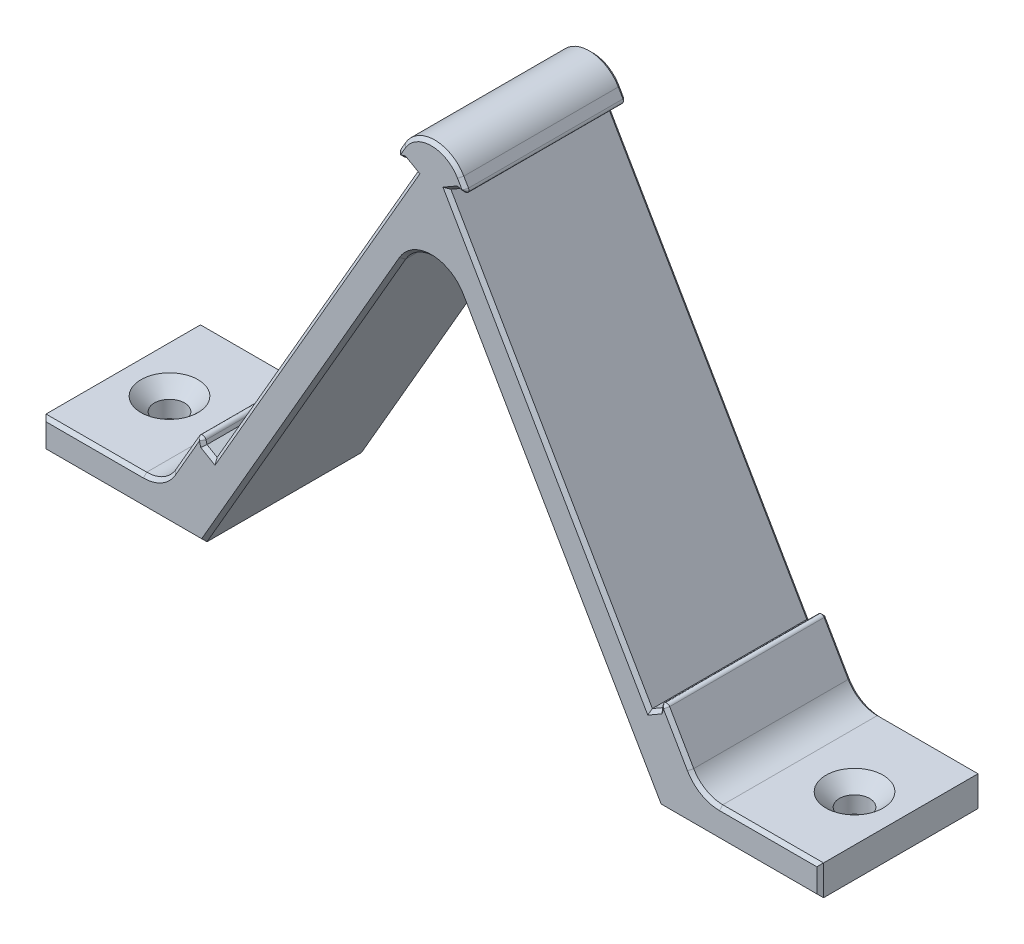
ISO-10303-21;
HEADER;
FILE_DESCRIPTION(('STEP AP214'),'2;1');
FILE_NAME('part.step','',(''),(''),'','','');
FILE_SCHEMA(('AUTOMOTIVE_DESIGN { 1 0 10303 214 1 1 1 1 }'));
ENDSEC;
DATA;
#1=APPLICATION_CONTEXT('core data for automotive mechanical design processes');
#2=APPLICATION_PROTOCOL_DEFINITION('international standard','automotive_design',2000,#1);
#3=PRODUCT_CONTEXT('',#1,'mechanical');
#4=PRODUCT('Part','Part','',(#3));
#5=PRODUCT_RELATED_PRODUCT_CATEGORY('part','',(#4));
#6=PRODUCT_DEFINITION_FORMATION('','',#4);
#7=PRODUCT_DEFINITION_CONTEXT('part definition',#1,'design');
#8=PRODUCT_DEFINITION('design','',#6,#7);
#9=PRODUCT_DEFINITION_SHAPE('','',#8);
#10=(LENGTH_UNIT() NAMED_UNIT(*) SI_UNIT(.MILLI.,.METRE.));
#11=(NAMED_UNIT(*) PLANE_ANGLE_UNIT() SI_UNIT($,.RADIAN.));
#12=(NAMED_UNIT(*) SI_UNIT($,.STERADIAN.) SOLID_ANGLE_UNIT());
#13=UNCERTAINTY_MEASURE_WITH_UNIT(LENGTH_MEASURE(1.E-05),#10,'distance_accuracy_value','');
#14=(GEOMETRIC_REPRESENTATION_CONTEXT(3) GLOBAL_UNCERTAINTY_ASSIGNED_CONTEXT((#13)) GLOBAL_UNIT_ASSIGNED_CONTEXT((#10,
#11,#12)) REPRESENTATION_CONTEXT('',''));
#15=CARTESIAN_POINT('',(0.,0.,0.));
#16=DIRECTION('',(0.,0.,1.));
#17=DIRECTION('',(1.,0.,0.));
#18=AXIS2_PLACEMENT_3D('',#15,#16,#17);
#19=CARTESIAN_POINT('',(-57.8867513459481,-8.69285066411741,12.));
#20=DIRECTION('',(1.,0.,0.));
#21=DIRECTION('',(0.,0.,-1.));
#22=AXIS2_PLACEMENT_3D('',#19,#20,#21);
#23=PLANE('',#22);
#24=DIRECTION('',(0.,0.,-1.));
#25=VECTOR('',#24,1.);
#26=CARTESIAN_POINT('',(-57.8867513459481,-8.69285066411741,12.));
#27=LINE('',#26,#25);
#28=CARTESIAN_POINT('',(-57.8867513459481,-8.69285066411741,11.5));
#29=VERTEX_POINT('',#28);
#30=CARTESIAN_POINT('',(-57.8867513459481,-8.69285066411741,-11.5));
#31=VERTEX_POINT('',#30);
#32=EDGE_CURVE('E1040',#29,#31,#27,.T.);
#33=ORIENTED_EDGE('',*,*,#32,.T.);
#34=DIRECTION('',(0.,-1.,0.));
#35=VECTOR('',#34,1.);
#36=CARTESIAN_POINT('',(-57.8867513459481,-13.1853650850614,-11.5));
#37=LINE('',#36,#35);
#38=CARTESIAN_POINT('',(-57.8867513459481,-13.1853650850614,-11.5));
#39=VERTEX_POINT('',#38);
#40=EDGE_CURVE('E598',#31,#39,#37,.T.);
#41=ORIENTED_EDGE('',*,*,#40,.T.);
#42=DIRECTION('',(0.,0.,-1.));
#43=VECTOR('',#42,1.);
#44=CARTESIAN_POINT('',(-57.8867513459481,-13.1853650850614,12.));
#45=LINE('',#44,#43);
#46=CARTESIAN_POINT('',(-57.8867513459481,-13.1853650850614,11.5));
#47=VERTEX_POINT('',#46);
#48=EDGE_CURVE('E409',#47,#39,#45,.T.);
#49=ORIENTED_EDGE('',*,*,#48,.F.);
#50=DIRECTION('',(0.,1.,0.));
#51=VECTOR('',#50,1.);
#52=CARTESIAN_POINT('',(-57.8867513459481,-8.69285066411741,11.5));
#53=LINE('',#52,#51);
#54=EDGE_CURVE('E596',#47,#29,#53,.T.);
#55=ORIENTED_EDGE('',*,*,#54,.T.);
#56=EDGE_LOOP('',(#33,#41,#49,#55));
#57=FACE_BOUND('',#56,.T.);
#58=ADVANCED_FACE('F33',(#57),#23,.F.);
#59=CARTESIAN_POINT('',(-57.8867513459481,-13.1853650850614,12.));
#60=DIRECTION('',(0.,1.,0.));
#61=DIRECTION('',(-1.,0.,0.));
#62=AXIS2_PLACEMENT_3D('',#59,#60,#61);
#63=PLANE('',#62);
#64=CARTESIAN_POINT('',(-51.,-13.1853650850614,0.));
#65=DIRECTION('',(0.,1.,0.));
#66=DIRECTION('',(-1.,0.,0.));
#67=AXIS2_PLACEMENT_3D('',#64,#65,#66);
#68=CIRCLE('',#67,2.25);
#69=CARTESIAN_POINT('',(-53.25,-13.1853650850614,0.));
#70=VERTEX_POINT('',#69);
#71=EDGE_CURVE('E1037',#70,#70,#68,.T.);
#72=ORIENTED_EDGE('',*,*,#71,.T.);
#73=EDGE_LOOP('',(#72));
#74=FACE_BOUND('',#73,.T.);
#75=ORIENTED_EDGE('',*,*,#48,.T.);
#76=DIRECTION('',(1.,0.,0.));
#77=VECTOR('',#76,1.);
#78=CARTESIAN_POINT('',(-33.9174682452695,-13.1853650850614,-11.5));
#79=LINE('',#78,#77);
#80=CARTESIAN_POINT('',(-33.9174682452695,-13.1853650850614,-11.5));
#81=VERTEX_POINT('',#80);
#82=EDGE_CURVE('E408',#39,#81,#79,.T.);
#83=ORIENTED_EDGE('',*,*,#82,.T.);
#84=DIRECTION('',(0.,0.,-1.));
#85=VECTOR('',#84,1.);
#86=CARTESIAN_POINT('',(-33.9174682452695,-13.1853650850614,12.));
#87=LINE('',#86,#85);
#88=CARTESIAN_POINT('',(-33.9174682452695,-13.1853650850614,11.5));
#89=VERTEX_POINT('',#88);
#90=EDGE_CURVE('E390',#89,#81,#87,.T.);
#91=ORIENTED_EDGE('',*,*,#90,.F.);
#92=DIRECTION('',(-1.,0.,0.));
#93=VECTOR('',#92,1.);
#94=CARTESIAN_POINT('',(-57.8867513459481,-13.1853650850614,11.5));
#95=LINE('',#94,#93);
#96=EDGE_CURVE('E405',#89,#47,#95,.T.);
#97=ORIENTED_EDGE('',*,*,#96,.T.);
#98=EDGE_LOOP('',(#75,#83,#91,#97));
#99=FACE_BOUND('',#98,.T.);
#100=ADVANCED_FACE('F403',(#74,#99),#63,.F.);
#101=CARTESIAN_POINT('',(-33.9174682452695,-13.1853650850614,12.));
#102=DIRECTION('',(-0.866025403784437,0.500000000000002,0.));
#103=DIRECTION('',(-0.500000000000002,-0.866025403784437,0.));
#104=AXIS2_PLACEMENT_3D('',#101,#102,#103);
#105=PLANE('',#104);
#106=ORIENTED_EDGE('',*,*,#90,.T.);
#107=DIRECTION('',(0.500000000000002,0.866025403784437,0.));
#108=VECTOR('',#107,1.);
#109=CARTESIAN_POINT('',(-4.33012701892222,38.0614131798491,-11.5));
#110=LINE('',#109,#108);
#111=CARTESIAN_POINT('',(-4.33012701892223,38.0614131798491,-11.5));
#112=VERTEX_POINT('',#111);
#113=EDGE_CURVE('E397',#81,#112,#110,.T.);
#114=ORIENTED_EDGE('',*,*,#113,.T.);
#115=DIRECTION('',(0.,0.,-1.));
#116=VECTOR('',#115,1.);
#117=CARTESIAN_POINT('',(-4.33012701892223,38.0614131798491,12.));
#118=LINE('',#117,#116);
#119=CARTESIAN_POINT('',(-4.33012701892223,38.0614131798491,11.5));
#120=VERTEX_POINT('',#119);
#121=EDGE_CURVE('E392',#120,#112,#118,.T.);
#122=ORIENTED_EDGE('',*,*,#121,.F.);
#123=DIRECTION('',(-0.500000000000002,-0.866025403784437,0.));
#124=VECTOR('',#123,1.);
#125=CARTESIAN_POINT('',(-33.9174682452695,-13.1853650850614,11.5));
#126=LINE('',#125,#124);
#127=EDGE_CURVE('E387',#120,#89,#126,.T.);
#128=ORIENTED_EDGE('',*,*,#127,.T.);
#129=EDGE_LOOP('',(#106,#114,#122,#128));
#130=FACE_BOUND('',#129,.T.);
#131=ADVANCED_FACE('F389',(#130),#105,.F.);
#132=CARTESIAN_POINT('',(0.,35.5614131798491,12.));
#133=DIRECTION('',(0.,0.,-1.));
#134=DIRECTION('',(-1.,0.,0.));
#135=AXIS2_PLACEMENT_3D('',#132,#133,#134);
#136=CYLINDRICAL_SURFACE('',#135,5.);
#137=ORIENTED_EDGE('',*,*,#121,.T.);
#138=CARTESIAN_POINT('',(0.,35.5614131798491,-11.5));
#139=DIRECTION('',(0.,0.,-1.));
#140=DIRECTION('',(-1.,0.,0.));
#141=AXIS2_PLACEMENT_3D('',#138,#139,#140);
#142=CIRCLE('',#141,5.);
#143=CARTESIAN_POINT('',(4.33012701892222,38.0614131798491,-11.5));
#144=VERTEX_POINT('',#143);
#145=EDGE_CURVE('E489',#112,#144,#142,.T.);
#146=ORIENTED_EDGE('',*,*,#145,.T.);
#147=DIRECTION('',(0.,0.,-1.));
#148=VECTOR('',#147,1.);
#149=CARTESIAN_POINT('',(4.33012701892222,38.0614131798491,12.));
#150=LINE('',#149,#148);
#151=CARTESIAN_POINT('',(4.33012701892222,38.0614131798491,11.5));
#152=VERTEX_POINT('',#151);
#153=EDGE_CURVE('E870',#152,#144,#150,.T.);
#154=ORIENTED_EDGE('',*,*,#153,.F.);
#155=CARTESIAN_POINT('',(0.,35.5614131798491,11.5));
#156=DIRECTION('',(0.,0.,-1.));
#157=DIRECTION('',(-1.,0.,0.));
#158=AXIS2_PLACEMENT_3D('',#155,#156,#157);
#159=CIRCLE('',#158,5.);
#160=EDGE_CURVE('E487',#152,#120,#159,.F.);
#161=ORIENTED_EDGE('',*,*,#160,.T.);
#162=EDGE_LOOP('',(#137,#146,#154,#161));
#163=FACE_BOUND('',#162,.T.);
#164=ADVANCED_FACE('F916',(#163),#136,.F.);
#165=CARTESIAN_POINT('',(4.33012701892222,38.0614131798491,12.));
#166=DIRECTION('',(0.866025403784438,0.5,0.));
#167=DIRECTION('',(-0.5,0.866025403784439,0.));
#168=AXIS2_PLACEMENT_3D('',#165,#166,#167);
#169=PLANE('',#168);
#170=ORIENTED_EDGE('',*,*,#153,.T.);
#171=DIRECTION('',(0.5,-0.866025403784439,0.));
#172=VECTOR('',#171,1.);
#173=CARTESIAN_POINT('',(33.9174682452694,-13.1853650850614,-11.5));
#174=LINE('',#173,#172);
#175=CARTESIAN_POINT('',(33.9174682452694,-13.1853650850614,-11.5));
#176=VERTEX_POINT('',#175);
#177=EDGE_CURVE('E493',#144,#176,#174,.T.);
#178=ORIENTED_EDGE('',*,*,#177,.T.);
#179=DIRECTION('',(0.,0.,-1.));
#180=VECTOR('',#179,1.);
#181=CARTESIAN_POINT('',(33.9174682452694,-13.1853650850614,12.));
#182=LINE('',#181,#180);
#183=CARTESIAN_POINT('',(33.9174682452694,-13.1853650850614,11.5));
#184=VERTEX_POINT('',#183);
#185=EDGE_CURVE('E867',#184,#176,#182,.T.);
#186=ORIENTED_EDGE('',*,*,#185,.F.);
#187=DIRECTION('',(-0.5,0.866025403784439,0.));
#188=VECTOR('',#187,1.);
#189=CARTESIAN_POINT('',(4.33012701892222,38.0614131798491,11.5));
#190=LINE('',#189,#188);
#191=EDGE_CURVE('E491',#184,#152,#190,.T.);
#192=ORIENTED_EDGE('',*,*,#191,.T.);
#193=EDGE_LOOP('',(#170,#178,#186,#192));
#194=FACE_BOUND('',#193,.T.);
#195=ADVANCED_FACE('F919',(#194),#169,.F.);
#196=CARTESIAN_POINT('',(33.9174682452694,-13.1853650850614,12.));
#197=DIRECTION('',(0.,1.,0.));
#198=DIRECTION('',(-1.,0.,0.));
#199=AXIS2_PLACEMENT_3D('',#196,#197,#198);
#200=PLANE('',#199);
#201=CARTESIAN_POINT('',(51.,-13.1853650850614,0.));
#202=DIRECTION('',(0.,1.,0.));
#203=DIRECTION('',(-1.,0.,0.));
#204=AXIS2_PLACEMENT_3D('',#201,#202,#203);
#205=CIRCLE('',#204,2.25);
#206=CARTESIAN_POINT('',(48.75,-13.1853650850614,0.));
#207=VERTEX_POINT('',#206);
#208=EDGE_CURVE('E735',#207,#207,#205,.T.);
#209=ORIENTED_EDGE('',*,*,#208,.T.);
#210=EDGE_LOOP('',(#209));
#211=FACE_BOUND('',#210,.T.);
#212=ORIENTED_EDGE('',*,*,#185,.T.);
#213=DIRECTION('',(1.,0.,0.));
#214=VECTOR('',#213,1.);
#215=CARTESIAN_POINT('',(57.8867513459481,-13.1853650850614,-11.5));
#216=LINE('',#215,#214);
#217=CARTESIAN_POINT('',(57.8867513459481,-13.1853650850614,-11.5));
#218=VERTEX_POINT('',#217);
#219=EDGE_CURVE('E497',#176,#218,#216,.T.);
#220=ORIENTED_EDGE('',*,*,#219,.T.);
#221=DIRECTION('',(0.,0.,-1.));
#222=VECTOR('',#221,1.);
#223=CARTESIAN_POINT('',(57.8867513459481,-13.1853650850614,12.));
#224=LINE('',#223,#222);
#225=CARTESIAN_POINT('',(57.8867513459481,-13.1853650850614,11.5));
#226=VERTEX_POINT('',#225);
#227=EDGE_CURVE('E864',#226,#218,#224,.T.);
#228=ORIENTED_EDGE('',*,*,#227,.F.);
#229=DIRECTION('',(-1.,0.,0.));
#230=VECTOR('',#229,1.);
#231=CARTESIAN_POINT('',(33.9174682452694,-13.1853650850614,11.5));
#232=LINE('',#231,#230);
#233=EDGE_CURVE('E495',#226,#184,#232,.T.);
#234=ORIENTED_EDGE('',*,*,#233,.T.);
#235=EDGE_LOOP('',(#212,#220,#228,#234));
#236=FACE_BOUND('',#235,.T.);
#237=ADVANCED_FACE('F923',(#211,#236),#200,.F.);
#238=CARTESIAN_POINT('',(57.8867513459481,-13.1853650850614,12.));
#239=DIRECTION('',(-1.,0.,0.));
#240=DIRECTION('',(0.,0.,1.));
#241=AXIS2_PLACEMENT_3D('',#238,#239,#240);
#242=PLANE('',#241);
#243=ORIENTED_EDGE('',*,*,#227,.T.);
#244=DIRECTION('',(0.,1.,0.));
#245=VECTOR('',#244,1.);
#246=CARTESIAN_POINT('',(57.8867513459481,-8.6928506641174,-11.5));
#247=LINE('',#246,#245);
#248=CARTESIAN_POINT('',(57.8867513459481,-8.6928506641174,-11.5));
#249=VERTEX_POINT('',#248);
#250=EDGE_CURVE('E501',#218,#249,#247,.T.);
#251=ORIENTED_EDGE('',*,*,#250,.T.);
#252=DIRECTION('',(0.,0.,-1.));
#253=VECTOR('',#252,1.);
#254=CARTESIAN_POINT('',(57.8867513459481,-8.6928506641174,12.));
#255=LINE('',#254,#253);
#256=CARTESIAN_POINT('',(57.8867513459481,-8.6928506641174,11.5));
#257=VERTEX_POINT('',#256);
#258=EDGE_CURVE('E861',#257,#249,#255,.T.);
#259=ORIENTED_EDGE('',*,*,#258,.F.);
#260=DIRECTION('',(0.,-1.,0.));
#261=VECTOR('',#260,1.);
#262=CARTESIAN_POINT('',(57.8867513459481,-13.1853650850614,11.5));
#263=LINE('',#262,#261);
#264=EDGE_CURVE('E499',#257,#226,#263,.T.);
#265=ORIENTED_EDGE('',*,*,#264,.T.);
#266=EDGE_LOOP('',(#243,#251,#259,#265));
#267=FACE_BOUND('',#266,.T.);
#268=ADVANCED_FACE('F927',(#267),#242,.F.);
#269=CARTESIAN_POINT('',(42.8867513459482,-8.69285066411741,12.));
#270=DIRECTION('',(0.,-1.,0.));
#271=DIRECTION('',(1.,0.,0.));
#272=AXIS2_PLACEMENT_3D('',#269,#270,#271);
#273=PLANE('',#272);
#274=CARTESIAN_POINT('',(51.,-8.69285066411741,0.));
#275=DIRECTION('',(0.,-1.,0.));
#276=DIRECTION('',(1.,0.,0.));
#277=AXIS2_PLACEMENT_3D('',#274,#275,#276);
#278=CIRCLE('',#277,4.24999999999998);
#279=CARTESIAN_POINT('',(55.25,-8.6928506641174,0.));
#280=VERTEX_POINT('',#279);
#281=EDGE_CURVE('E878',#280,#280,#278,.T.);
#282=ORIENTED_EDGE('',*,*,#281,.T.);
#283=EDGE_LOOP('',(#282));
#284=FACE_BOUND('',#283,.T.);
#285=ORIENTED_EDGE('',*,*,#258,.T.);
#286=DIRECTION('',(-1.,0.,0.));
#287=VECTOR('',#286,1.);
#288=CARTESIAN_POINT('',(42.8867513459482,-8.69285066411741,-11.5));
#289=LINE('',#288,#287);
#290=CARTESIAN_POINT('',(42.8867513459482,-8.69285066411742,-11.5));
#291=VERTEX_POINT('',#290);
#292=EDGE_CURVE('E505',#249,#291,#289,.T.);
#293=ORIENTED_EDGE('',*,*,#292,.T.);
#294=DIRECTION('',(0.,0.,-1.));
#295=VECTOR('',#294,1.);
#296=CARTESIAN_POINT('',(42.8867513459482,-8.69285066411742,12.));
#297=LINE('',#296,#295);
#298=CARTESIAN_POINT('',(42.8867513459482,-8.69285066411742,11.5));
#299=VERTEX_POINT('',#298);
#300=EDGE_CURVE('E858',#299,#291,#297,.T.);
#301=ORIENTED_EDGE('',*,*,#300,.F.);
#302=DIRECTION('',(1.,0.,0.));
#303=VECTOR('',#302,1.);
#304=CARTESIAN_POINT('',(42.8867513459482,-8.69285066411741,11.5));
#305=LINE('',#304,#303);
#306=EDGE_CURVE('E503',#299,#257,#305,.T.);
#307=ORIENTED_EDGE('',*,*,#306,.T.);
#308=EDGE_LOOP('',(#285,#293,#301,#307));
#309=FACE_BOUND('',#308,.T.);
#310=ADVANCED_FACE('F931',(#284,#309),#273,.F.);
#311=CARTESIAN_POINT('',(42.8867513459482,-3.69285066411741,12.));
#312=DIRECTION('',(0.,0.,-1.));
#313=DIRECTION('',(-1.,0.,0.));
#314=AXIS2_PLACEMENT_3D('',#311,#312,#313);
#315=CYLINDRICAL_SURFACE('',#314,5.);
#316=ORIENTED_EDGE('',*,*,#300,.T.);
#317=CARTESIAN_POINT('',(42.8867513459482,-3.69285066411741,-11.5));
#318=DIRECTION('',(0.,0.,-1.));
#319=DIRECTION('',(-1.,0.,0.));
#320=AXIS2_PLACEMENT_3D('',#317,#318,#319);
#321=CIRCLE('',#320,5.);
#322=CARTESIAN_POINT('',(38.556624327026,-6.1928506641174,-11.5));
#323=VERTEX_POINT('',#322);
#324=EDGE_CURVE('E509',#291,#323,#321,.T.);
#325=ORIENTED_EDGE('',*,*,#324,.T.);
#326=DIRECTION('',(0.,0.,-1.));
#327=VECTOR('',#326,1.);
#328=CARTESIAN_POINT('',(38.556624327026,-6.1928506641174,12.));
#329=LINE('',#328,#327);
#330=CARTESIAN_POINT('',(38.556624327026,-6.1928506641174,11.5));
#331=VERTEX_POINT('',#330);
#332=EDGE_CURVE('E855',#331,#323,#329,.T.);
#333=ORIENTED_EDGE('',*,*,#332,.F.);
#334=CARTESIAN_POINT('',(42.8867513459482,-3.69285066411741,11.5));
#335=DIRECTION('',(0.,0.,-1.));
#336=DIRECTION('',(-1.,0.,0.));
#337=AXIS2_PLACEMENT_3D('',#334,#335,#336);
#338=CIRCLE('',#337,5.);
#339=EDGE_CURVE('E507',#331,#299,#338,.F.);
#340=ORIENTED_EDGE('',*,*,#339,.T.);
#341=EDGE_LOOP('',(#316,#325,#333,#340));
#342=FACE_BOUND('',#341,.T.);
#343=ADVANCED_FACE('F935',(#342),#315,.F.);
#344=CARTESIAN_POINT('',(38.556624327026,-6.1928506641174,12.));
#345=DIRECTION('',(-0.866025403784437,-0.500000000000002,0.));
#346=DIRECTION('',(0.500000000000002,-0.866025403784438,0.));
#347=AXIS2_PLACEMENT_3D('',#344,#345,#346);
#348=PLANE('',#347);
#349=ORIENTED_EDGE('',*,*,#332,.T.);
#350=DIRECTION('',(-0.500000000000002,0.866025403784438,0.));
#351=VECTOR('',#350,1.);
#352=CARTESIAN_POINT('',(34.9785533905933,0.00454999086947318,-11.5));
#353=LINE('',#352,#351);
#354=CARTESIAN_POINT('',(34.9785533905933,0.00454999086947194,-11.5));
#355=VERTEX_POINT('',#354);
#356=EDGE_CURVE('E513',#323,#355,#353,.T.);
#357=ORIENTED_EDGE('',*,*,#356,.T.);
#358=DIRECTION('',(0.,0.,-1.));
#359=VECTOR('',#358,1.);
#360=CARTESIAN_POINT('',(34.9785533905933,0.00454999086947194,12.));
#361=LINE('',#360,#359);
#362=CARTESIAN_POINT('',(34.9785533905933,0.00454999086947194,11.5));
#363=VERTEX_POINT('',#362);
#364=EDGE_CURVE('E852',#363,#355,#361,.T.);
#365=ORIENTED_EDGE('',*,*,#364,.F.);
#366=DIRECTION('',(0.500000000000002,-0.866025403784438,0.));
#367=VECTOR('',#366,1.);
#368=CARTESIAN_POINT('',(38.556624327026,-6.1928506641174,11.5));
#369=LINE('',#368,#367);
#370=EDGE_CURVE('E511',#363,#331,#369,.T.);
#371=ORIENTED_EDGE('',*,*,#370,.T.);
#372=EDGE_LOOP('',(#349,#357,#365,#371));
#373=FACE_BOUND('',#372,.T.);
#374=ADVANCED_FACE('F939',(#373),#348,.F.);
#375=CARTESIAN_POINT('',(34.5455406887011,-0.245450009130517,12.));
#376=DIRECTION('',(0.,0.,-1.));
#377=DIRECTION('',(-1.,0.,0.));
#378=AXIS2_PLACEMENT_3D('',#375,#376,#377);
#379=CYLINDRICAL_SURFACE('',#378,0.500000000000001);
#380=ORIENTED_EDGE('',*,*,#364,.T.);
#381=CARTESIAN_POINT('',(34.5455406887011,-0.245450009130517,-11.5));
#382=DIRECTION('',(0.,0.,-1.));
#383=DIRECTION('',(-1.,0.,0.));
#384=AXIS2_PLACEMENT_3D('',#381,#382,#383);
#385=CIRCLE('',#384,0.500000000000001);
#386=CARTESIAN_POINT('',(34.0625777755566,-0.116040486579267,-11.5));
#387=VERTEX_POINT('',#386);
#388=EDGE_CURVE('E517',#355,#387,#385,.F.);
#389=ORIENTED_EDGE('',*,*,#388,.T.);
#390=DIRECTION('',(0.,0.,-1.));
#391=VECTOR('',#390,1.);
#392=CARTESIAN_POINT('',(34.0625777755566,-0.116040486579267,12.));
#393=LINE('',#392,#391);
#394=CARTESIAN_POINT('',(34.0625777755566,-0.116040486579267,11.5));
#395=VERTEX_POINT('',#394);
#396=EDGE_CURVE('E849',#395,#387,#393,.T.);
#397=ORIENTED_EDGE('',*,*,#396,.F.);
#398=CARTESIAN_POINT('',(34.5455406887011,-0.245450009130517,11.5));
#399=DIRECTION('',(0.,0.,-1.));
#400=DIRECTION('',(-1.,0.,0.));
#401=AXIS2_PLACEMENT_3D('',#398,#399,#400);
#402=CIRCLE('',#401,0.500000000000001);
#403=EDGE_CURVE('E515',#395,#363,#402,.T.);
#404=ORIENTED_EDGE('',*,*,#403,.T.);
#405=EDGE_LOOP('',(#380,#389,#397,#404));
#406=FACE_BOUND('',#405,.T.);
#407=ADVANCED_FACE('F943',(#406),#379,.T.);
#408=CARTESIAN_POINT('',(33.9174682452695,-0.65759662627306,12.));
#409=DIRECTION('',(0.965925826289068,-0.258819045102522,0.));
#410=DIRECTION('',(0.258819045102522,0.965925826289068,0.));
#411=AXIS2_PLACEMENT_3D('',#408,#409,#410);
#412=PLANE('',#411);
#413=ORIENTED_EDGE('',*,*,#396,.T.);
#414=DIRECTION('',(-0.258819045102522,-0.965925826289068,0.));
#415=VECTOR('',#414,1.);
#416=CARTESIAN_POINT('',(33.9174682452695,-0.65759662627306,-11.5));
#417=LINE('',#416,#415);
#418=CARTESIAN_POINT('',(33.9174682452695,-0.65759662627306,-11.5));
#419=VERTEX_POINT('',#418);
#420=EDGE_CURVE('E521',#387,#419,#417,.T.);
#421=ORIENTED_EDGE('',*,*,#420,.T.);
#422=DIRECTION('',(0.,0.,-1.));
#423=VECTOR('',#422,1.);
#424=CARTESIAN_POINT('',(33.9174682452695,-0.65759662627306,12.));
#425=LINE('',#424,#423);
#426=CARTESIAN_POINT('',(33.9174682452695,-0.65759662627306,11.5));
#427=VERTEX_POINT('',#426);
#428=EDGE_CURVE('E841',#427,#419,#425,.T.);
#429=ORIENTED_EDGE('',*,*,#428,.F.);
#430=DIRECTION('',(0.258819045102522,0.965925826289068,0.));
#431=VECTOR('',#430,1.);
#432=CARTESIAN_POINT('',(33.9174682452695,-0.65759662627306,11.5));
#433=LINE('',#432,#431);
#434=EDGE_CURVE('E519',#427,#395,#433,.T.);
#435=ORIENTED_EDGE('',*,*,#434,.T.);
#436=EDGE_LOOP('',(#413,#421,#429,#435));
#437=FACE_BOUND('',#436,.T.);
#438=ADVANCED_FACE('F947',(#437),#412,.F.);
#439=CARTESIAN_POINT('',(33.9174682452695,-0.65759662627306,12.));
#440=DIRECTION('',(0.499999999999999,-0.866025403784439,0.));
#441=DIRECTION('',(0.866025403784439,0.499999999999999,0.));
#442=AXIS2_PLACEMENT_3D('',#439,#440,#441);
#443=PLANE('',#442);
#444=ORIENTED_EDGE('',*,*,#428,.T.);
#445=DIRECTION('',(-0.866025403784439,-0.499999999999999,0.));
#446=VECTOR('',#445,1.);
#447=CARTESIAN_POINT('',(32.4019237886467,-1.53259662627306,-11.5));
#448=LINE('',#447,#446);
#449=CARTESIAN_POINT('',(32.4019237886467,-1.53259662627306,-11.5));
#450=VERTEX_POINT('',#449);
#451=EDGE_CURVE('E525',#419,#450,#448,.T.);
#452=ORIENTED_EDGE('',*,*,#451,.T.);
#453=DIRECTION('',(0.,0.,-1.));
#454=VECTOR('',#453,1.);
#455=CARTESIAN_POINT('',(32.4019237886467,-1.53259662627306,12.));
#456=LINE('',#455,#454);
#457=CARTESIAN_POINT('',(32.4019237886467,-1.53259662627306,11.5));
#458=VERTEX_POINT('',#457);
#459=EDGE_CURVE('E839',#458,#450,#456,.T.);
#460=ORIENTED_EDGE('',*,*,#459,.F.);
#461=DIRECTION('',(0.866025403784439,0.499999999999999,0.));
#462=VECTOR('',#461,1.);
#463=CARTESIAN_POINT('',(33.9174682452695,-0.65759662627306,11.5));
#464=LINE('',#463,#462);
#465=EDGE_CURVE('E523',#458,#427,#464,.T.);
#466=ORIENTED_EDGE('',*,*,#465,.T.);
#467=EDGE_LOOP('',(#444,#452,#460,#466));
#468=FACE_BOUND('',#467,.T.);
#469=ADVANCED_FACE('F951',(#468),#443,.F.);
#470=CARTESIAN_POINT('',(2.40192378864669,50.4289276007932,12.));
#471=DIRECTION('',(-0.866025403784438,-0.500000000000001,0.));
#472=DIRECTION('',(0.500000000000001,-0.866025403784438,0.));
#473=AXIS2_PLACEMENT_3D('',#470,#471,#472);
#474=PLANE('',#473);
#475=ORIENTED_EDGE('',*,*,#459,.T.);
#476=DIRECTION('',(-0.500000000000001,0.866025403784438,0.));
#477=VECTOR('',#476,1.);
#478=CARTESIAN_POINT('',(2.40192378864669,50.4289276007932,-11.5));
#479=LINE('',#478,#477);
#480=CARTESIAN_POINT('',(2.40192378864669,50.4289276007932,-11.5));
#481=VERTEX_POINT('',#480);
#482=EDGE_CURVE('E529',#450,#481,#479,.T.);
#483=ORIENTED_EDGE('',*,*,#482,.T.);
#484=DIRECTION('',(0.,0.,-1.));
#485=VECTOR('',#484,1.);
#486=CARTESIAN_POINT('',(2.40192378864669,50.4289276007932,12.));
#487=LINE('',#486,#485);
#488=CARTESIAN_POINT('',(2.40192378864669,50.4289276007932,11.5));
#489=VERTEX_POINT('',#488);
#490=EDGE_CURVE('E830',#489,#481,#487,.T.);
#491=ORIENTED_EDGE('',*,*,#490,.F.);
#492=DIRECTION('',(0.500000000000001,-0.866025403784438,0.));
#493=VECTOR('',#492,1.);
#494=CARTESIAN_POINT('',(2.40192378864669,50.4289276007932,11.5));
#495=LINE('',#494,#493);
#496=EDGE_CURVE('E527',#489,#458,#495,.T.);
#497=ORIENTED_EDGE('',*,*,#496,.T.);
#498=EDGE_LOOP('',(#475,#483,#491,#497));
#499=FACE_BOUND('',#498,.T.);
#500=ADVANCED_FACE('F836',(#499),#474,.F.);
#501=CARTESIAN_POINT('',(3.91746824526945,51.3039276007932,12.));
#502=DIRECTION('',(-0.500000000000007,0.866025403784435,0.));
#503=DIRECTION('',(-0.866025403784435,-0.500000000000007,0.));
#504=AXIS2_PLACEMENT_3D('',#501,#502,#503);
#505=PLANE('',#504);
#506=ORIENTED_EDGE('',*,*,#490,.T.);
#507=DIRECTION('',(0.866025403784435,0.500000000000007,0.));
#508=VECTOR('',#507,1.);
#509=CARTESIAN_POINT('',(3.91746824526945,51.3039276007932,-11.5));
#510=LINE('',#509,#508);
#511=CARTESIAN_POINT('',(3.91746824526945,51.3039276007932,-11.5));
#512=VERTEX_POINT('',#511);
#513=EDGE_CURVE('E533',#481,#512,#510,.T.);
#514=ORIENTED_EDGE('',*,*,#513,.T.);
#515=DIRECTION('',(0.,0.,-1.));
#516=VECTOR('',#515,1.);
#517=CARTESIAN_POINT('',(3.91746824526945,51.3039276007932,12.));
#518=LINE('',#517,#516);
#519=CARTESIAN_POINT('',(3.91746824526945,51.3039276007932,11.5));
#520=VERTEX_POINT('',#519);
#521=EDGE_CURVE('E833',#520,#512,#518,.T.);
#522=ORIENTED_EDGE('',*,*,#521,.F.);
#523=DIRECTION('',(-0.866025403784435,-0.500000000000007,0.));
#524=VECTOR('',#523,1.);
#525=CARTESIAN_POINT('',(3.91746824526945,51.3039276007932,11.5));
#526=LINE('',#525,#524);
#527=EDGE_CURVE('E531',#520,#489,#526,.T.);
#528=ORIENTED_EDGE('',*,*,#527,.T.);
#529=EDGE_LOOP('',(#506,#514,#522,#528));
#530=FACE_BOUND('',#529,.T.);
#531=ADVANCED_FACE('F829',(#530),#505,.F.);
#532=CARTESIAN_POINT('',(3.91746824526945,51.3039276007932,12.));
#533=DIRECTION('',(0.258819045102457,0.965925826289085,0.));
#534=DIRECTION('',(-0.965925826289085,0.258819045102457,0.));
#535=AXIS2_PLACEMENT_3D('',#532,#533,#534);
#536=PLANE('',#535);
#537=ORIENTED_EDGE('',*,*,#521,.T.);
#538=DIRECTION('',(0.965925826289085,-0.258819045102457,0.));
#539=VECTOR('',#538,1.);
#540=CARTESIAN_POINT('',(4.45902438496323,51.1588180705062,-11.5));
#541=LINE('',#540,#539);
#542=CARTESIAN_POINT('',(4.45902438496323,51.1588180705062,-11.5));
#543=VERTEX_POINT('',#542);
#544=EDGE_CURVE('E537',#512,#543,#541,.T.);
#545=ORIENTED_EDGE('',*,*,#544,.T.);
#546=DIRECTION('',(0.,0.,-1.));
#547=VECTOR('',#546,1.);
#548=CARTESIAN_POINT('',(4.45902438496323,51.1588180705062,12.));
#549=LINE('',#548,#547);
#550=CARTESIAN_POINT('',(4.45902438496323,51.1588180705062,11.5));
#551=VERTEX_POINT('',#550);
#552=EDGE_CURVE('E843',#551,#543,#549,.T.);
#553=ORIENTED_EDGE('',*,*,#552,.F.);
#554=DIRECTION('',(-0.965925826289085,0.258819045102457,0.));
#555=VECTOR('',#554,1.);
#556=CARTESIAN_POINT('',(3.91746824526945,51.3039276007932,11.5));
#557=LINE('',#556,#555);
#558=EDGE_CURVE('E535',#551,#520,#557,.T.);
#559=ORIENTED_EDGE('',*,*,#558,.T.);
#560=EDGE_LOOP('',(#537,#545,#553,#559));
#561=FACE_BOUND('',#560,.T.);
#562=ADVANCED_FACE('F960',(#561),#536,.F.);
#563=CARTESIAN_POINT('',(4.58843390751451,51.6417809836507,12.));
#564=DIRECTION('',(0.,0.,-1.));
#565=DIRECTION('',(-1.,0.,0.));
#566=AXIS2_PLACEMENT_3D('',#563,#564,#565);
#567=CYLINDRICAL_SURFACE('',#566,0.499999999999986);
#568=ORIENTED_EDGE('',*,*,#552,.T.);
#569=CARTESIAN_POINT('',(4.58843390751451,51.6417809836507,-11.5));
#570=DIRECTION('',(0.,0.,-1.));
#571=DIRECTION('',(-1.,0.,0.));
#572=AXIS2_PLACEMENT_3D('',#569,#570,#571);
#573=CIRCLE('',#572,0.499999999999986);
#574=CARTESIAN_POINT('',(5.02144660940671,51.8917809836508,-11.5));
#575=VERTEX_POINT('',#574);
#576=EDGE_CURVE('E541',#543,#575,#573,.F.);
#577=ORIENTED_EDGE('',*,*,#576,.T.);
#578=DIRECTION('',(0.,0.,-1.));
#579=VECTOR('',#578,1.);
#580=CARTESIAN_POINT('',(5.02144660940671,51.8917809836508,12.));
#581=LINE('',#580,#579);
#582=CARTESIAN_POINT('',(5.02144660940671,51.8917809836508,11.5));
#583=VERTEX_POINT('',#582);
#584=EDGE_CURVE('E1080',#583,#575,#581,.T.);
#585=ORIENTED_EDGE('',*,*,#584,.F.);
#586=CARTESIAN_POINT('',(4.58843390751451,51.6417809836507,11.5));
#587=DIRECTION('',(0.,0.,-1.));
#588=DIRECTION('',(-1.,0.,0.));
#589=AXIS2_PLACEMENT_3D('',#586,#587,#588);
#590=CIRCLE('',#589,0.499999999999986);
#591=EDGE_CURVE('E539',#583,#551,#590,.T.);
#592=ORIENTED_EDGE('',*,*,#591,.T.);
#593=EDGE_LOOP('',(#568,#577,#585,#592));
#594=FACE_BOUND('',#593,.T.);
#595=ADVANCED_FACE('F963',(#594),#567,.T.);
#596=CARTESIAN_POINT('',(5.02144660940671,51.8917809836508,12.));
#597=DIRECTION('',(-0.866025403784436,-0.500000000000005,0.));
#598=DIRECTION('',(0.500000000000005,-0.866025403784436,0.));
#599=AXIS2_PLACEMENT_3D('',#596,#597,#598);
#600=PLANE('',#599);
#601=ORIENTED_EDGE('',*,*,#584,.T.);
#602=DIRECTION('',(-0.500000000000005,0.866025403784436,0.));
#603=VECTOR('',#602,1.);
#604=CARTESIAN_POINT('',(4.33012701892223,53.0891816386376,-11.5));
#605=LINE('',#604,#603);
#606=CARTESIAN_POINT('',(4.33012701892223,53.0891816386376,-11.5));
#607=VERTEX_POINT('',#606);
#608=EDGE_CURVE('E545',#575,#607,#605,.T.);
#609=ORIENTED_EDGE('',*,*,#608,.T.);
#610=DIRECTION('',(0.,0.,-1.));
#611=VECTOR('',#610,1.);
#612=CARTESIAN_POINT('',(4.33012701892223,53.0891816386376,12.));
#613=LINE('',#612,#611);
#614=CARTESIAN_POINT('',(4.33012701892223,53.0891816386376,11.5));
#615=VERTEX_POINT('',#614);
#616=EDGE_CURVE('E1077',#615,#607,#613,.T.);
#617=ORIENTED_EDGE('',*,*,#616,.F.);
#618=DIRECTION('',(0.500000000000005,-0.866025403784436,0.));
#619=VECTOR('',#618,1.);
#620=CARTESIAN_POINT('',(5.02144660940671,51.8917809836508,11.5));
#621=LINE('',#620,#619);
#622=EDGE_CURVE('E543',#615,#583,#621,.T.);
#623=ORIENTED_EDGE('',*,*,#622,.T.);
#624=EDGE_LOOP('',(#601,#609,#617,#623));
#625=FACE_BOUND('',#624,.T.);
#626=ADVANCED_FACE('F967',(#625),#600,.F.);
#627=CARTESIAN_POINT('',(0.,50.5891816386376,12.));
#628=DIRECTION('',(0.,0.,-1.));
#629=DIRECTION('',(-1.,0.,0.));
#630=AXIS2_PLACEMENT_3D('',#627,#628,#629);
#631=CYLINDRICAL_SURFACE('',#630,5.);
#632=ORIENTED_EDGE('',*,*,#616,.T.);
#633=CARTESIAN_POINT('',(0.,50.5891816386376,-11.5));
#634=DIRECTION('',(0.,0.,-1.));
#635=DIRECTION('',(-1.,0.,0.));
#636=AXIS2_PLACEMENT_3D('',#633,#634,#635);
#637=CIRCLE('',#636,5.);
#638=CARTESIAN_POINT('',(-4.33012701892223,53.0891816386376,-11.5));
#639=VERTEX_POINT('',#638);
#640=EDGE_CURVE('E549',#607,#639,#637,.F.);
#641=ORIENTED_EDGE('',*,*,#640,.T.);
#642=DIRECTION('',(0.,0.,-1.));
#643=VECTOR('',#642,1.);
#644=CARTESIAN_POINT('',(-4.33012701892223,53.0891816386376,12.));
#645=LINE('',#644,#643);
#646=CARTESIAN_POINT('',(-4.33012701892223,53.0891816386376,11.5));
#647=VERTEX_POINT('',#646);
#648=EDGE_CURVE('E1074',#647,#639,#645,.T.);
#649=ORIENTED_EDGE('',*,*,#648,.F.);
#650=CARTESIAN_POINT('',(0.,50.5891816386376,11.5));
#651=DIRECTION('',(0.,0.,-1.));
#652=DIRECTION('',(-1.,0.,0.));
#653=AXIS2_PLACEMENT_3D('',#650,#651,#652);
#654=CIRCLE('',#653,5.);
#655=EDGE_CURVE('E547',#647,#615,#654,.T.);
#656=ORIENTED_EDGE('',*,*,#655,.T.);
#657=EDGE_LOOP('',(#632,#641,#649,#656));
#658=FACE_BOUND('',#657,.T.);
#659=ADVANCED_FACE('F971',(#658),#631,.T.);
#660=CARTESIAN_POINT('',(-5.02144660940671,51.8917809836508,12.));
#661=DIRECTION('',(0.866025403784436,-0.500000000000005,0.));
#662=DIRECTION('',(0.500000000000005,0.866025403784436,0.));
#663=AXIS2_PLACEMENT_3D('',#660,#661,#662);
#664=PLANE('',#663);
#665=ORIENTED_EDGE('',*,*,#648,.T.);
#666=DIRECTION('',(-0.500000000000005,-0.866025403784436,0.));
#667=VECTOR('',#666,1.);
#668=CARTESIAN_POINT('',(-5.02144660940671,51.8917809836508,-11.5));
#669=LINE('',#668,#667);
#670=CARTESIAN_POINT('',(-5.02144660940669,51.8917809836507,-11.5));
#671=VERTEX_POINT('',#670);
#672=EDGE_CURVE('E553',#639,#671,#669,.T.);
#673=ORIENTED_EDGE('',*,*,#672,.T.);
#674=DIRECTION('',(0.,0.,-1.));
#675=VECTOR('',#674,1.);
#676=CARTESIAN_POINT('',(-5.02144660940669,51.8917809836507,12.));
#677=LINE('',#676,#675);
#678=CARTESIAN_POINT('',(-5.02144660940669,51.8917809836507,11.5));
#679=VERTEX_POINT('',#678);
#680=EDGE_CURVE('E1071',#679,#671,#677,.T.);
#681=ORIENTED_EDGE('',*,*,#680,.F.);
#682=DIRECTION('',(0.500000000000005,0.866025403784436,0.));
#683=VECTOR('',#682,1.);
#684=CARTESIAN_POINT('',(-5.02144660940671,51.8917809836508,11.5));
#685=LINE('',#684,#683);
#686=EDGE_CURVE('E551',#679,#647,#685,.T.);
#687=ORIENTED_EDGE('',*,*,#686,.T.);
#688=EDGE_LOOP('',(#665,#673,#681,#687));
#689=FACE_BOUND('',#688,.T.);
#690=ADVANCED_FACE('F975',(#689),#664,.F.);
#691=CARTESIAN_POINT('',(-4.58843390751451,51.6417809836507,12.));
#692=DIRECTION('',(0.,0.,-1.));
#693=DIRECTION('',(-1.,0.,0.));
#694=AXIS2_PLACEMENT_3D('',#691,#692,#693);
#695=CYLINDRICAL_SURFACE('',#694,0.499999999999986);
#696=ORIENTED_EDGE('',*,*,#680,.T.);
#697=CARTESIAN_POINT('',(-4.58843390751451,51.6417809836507,-11.5));
#698=DIRECTION('',(0.,0.,-1.));
#699=DIRECTION('',(-1.,0.,0.));
#700=AXIS2_PLACEMENT_3D('',#697,#698,#699);
#701=CIRCLE('',#700,0.499999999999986);
#702=CARTESIAN_POINT('',(-4.45902438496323,51.1588180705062,-11.5));
#703=VERTEX_POINT('',#702);
#704=EDGE_CURVE('E557',#671,#703,#701,.F.);
#705=ORIENTED_EDGE('',*,*,#704,.T.);
#706=DIRECTION('',(0.,0.,-1.));
#707=VECTOR('',#706,1.);
#708=CARTESIAN_POINT('',(-4.45902438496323,51.1588180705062,12.));
#709=LINE('',#708,#707);
#710=CARTESIAN_POINT('',(-4.45902438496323,51.1588180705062,11.5));
#711=VERTEX_POINT('',#710);
#712=EDGE_CURVE('E1068',#711,#703,#709,.T.);
#713=ORIENTED_EDGE('',*,*,#712,.F.);
#714=CARTESIAN_POINT('',(-4.58843390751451,51.6417809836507,11.5));
#715=DIRECTION('',(0.,0.,-1.));
#716=DIRECTION('',(-1.,0.,0.));
#717=AXIS2_PLACEMENT_3D('',#714,#715,#716);
#718=CIRCLE('',#717,0.499999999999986);
#719=EDGE_CURVE('E555',#711,#679,#718,.T.);
#720=ORIENTED_EDGE('',*,*,#719,.T.);
#721=EDGE_LOOP('',(#696,#705,#713,#720));
#722=FACE_BOUND('',#721,.T.);
#723=ADVANCED_FACE('F979',(#722),#695,.T.);
#724=CARTESIAN_POINT('',(-3.91746824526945,51.3039276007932,12.));
#725=DIRECTION('',(-0.258819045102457,0.965925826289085,0.));
#726=DIRECTION('',(-0.965925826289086,-0.258819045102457,0.));
#727=AXIS2_PLACEMENT_3D('',#724,#725,#726);
#728=PLANE('',#727);
#729=ORIENTED_EDGE('',*,*,#712,.T.);
#730=DIRECTION('',(0.965925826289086,0.258819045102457,0.));
#731=VECTOR('',#730,1.);
#732=CARTESIAN_POINT('',(-3.91746824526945,51.3039276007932,-11.5));
#733=LINE('',#732,#731);
#734=CARTESIAN_POINT('',(-3.91746824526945,51.3039276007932,-11.5));
#735=VERTEX_POINT('',#734);
#736=EDGE_CURVE('E561',#703,#735,#733,.T.);
#737=ORIENTED_EDGE('',*,*,#736,.T.);
#738=DIRECTION('',(0.,0.,-1.));
#739=VECTOR('',#738,1.);
#740=CARTESIAN_POINT('',(-3.91746824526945,51.3039276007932,12.));
#741=LINE('',#740,#739);
#742=CARTESIAN_POINT('',(-3.91746824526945,51.3039276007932,11.5));
#743=VERTEX_POINT('',#742);
#744=EDGE_CURVE('E1065',#743,#735,#741,.T.);
#745=ORIENTED_EDGE('',*,*,#744,.F.);
#746=DIRECTION('',(-0.965925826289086,-0.258819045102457,0.));
#747=VECTOR('',#746,1.);
#748=CARTESIAN_POINT('',(-3.91746824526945,51.3039276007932,11.5));
#749=LINE('',#748,#747);
#750=EDGE_CURVE('E559',#743,#711,#749,.T.);
#751=ORIENTED_EDGE('',*,*,#750,.T.);
#752=EDGE_LOOP('',(#729,#737,#745,#751));
#753=FACE_BOUND('',#752,.T.);
#754=ADVANCED_FACE('F983',(#753),#728,.F.);
#755=CARTESIAN_POINT('',(-3.91746824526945,51.3039276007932,12.));
#756=DIRECTION('',(0.500000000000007,0.866025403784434,0.));
#757=DIRECTION('',(-0.866025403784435,0.500000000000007,0.));
#758=AXIS2_PLACEMENT_3D('',#755,#756,#757);
#759=PLANE('',#758);
#760=ORIENTED_EDGE('',*,*,#744,.T.);
#761=DIRECTION('',(0.866025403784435,-0.500000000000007,0.));
#762=VECTOR('',#761,1.);
#763=CARTESIAN_POINT('',(-2.40192378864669,50.4289276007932,-11.5));
#764=LINE('',#763,#762);
#765=CARTESIAN_POINT('',(-2.40192378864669,50.4289276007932,-11.5));
#766=VERTEX_POINT('',#765);
#767=EDGE_CURVE('E565',#735,#766,#764,.T.);
#768=ORIENTED_EDGE('',*,*,#767,.T.);
#769=DIRECTION('',(0.,0.,-1.));
#770=VECTOR('',#769,1.);
#771=CARTESIAN_POINT('',(-2.40192378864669,50.4289276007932,12.));
#772=LINE('',#771,#770);
#773=CARTESIAN_POINT('',(-2.40192378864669,50.4289276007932,11.5));
#774=VERTEX_POINT('',#773);
#775=EDGE_CURVE('E1062',#774,#766,#772,.T.);
#776=ORIENTED_EDGE('',*,*,#775,.F.);
#777=DIRECTION('',(-0.866025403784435,0.500000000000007,0.));
#778=VECTOR('',#777,1.);
#779=CARTESIAN_POINT('',(-3.91746824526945,51.3039276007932,11.5));
#780=LINE('',#779,#778);
#781=EDGE_CURVE('E563',#774,#743,#780,.T.);
#782=ORIENTED_EDGE('',*,*,#781,.T.);
#783=EDGE_LOOP('',(#760,#768,#776,#782));
#784=FACE_BOUND('',#783,.T.);
#785=ADVANCED_FACE('F987',(#784),#759,.F.);
#786=CARTESIAN_POINT('',(-2.40192378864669,50.4289276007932,12.));
#787=DIRECTION('',(0.866025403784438,-0.500000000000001,0.));
#788=DIRECTION('',(0.500000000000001,0.866025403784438,0.));
#789=AXIS2_PLACEMENT_3D('',#786,#787,#788);
#790=PLANE('',#789);
#791=ORIENTED_EDGE('',*,*,#775,.T.);
#792=DIRECTION('',(-0.500000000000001,-0.866025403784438,0.));
#793=VECTOR('',#792,1.);
#794=CARTESIAN_POINT('',(-32.4019237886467,-1.53259662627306,-11.5));
#795=LINE('',#794,#793);
#796=CARTESIAN_POINT('',(-32.4019237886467,-1.53259662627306,-11.5));
#797=VERTEX_POINT('',#796);
#798=EDGE_CURVE('E569',#766,#797,#795,.T.);
#799=ORIENTED_EDGE('',*,*,#798,.T.);
#800=DIRECTION('',(0.,0.,-1.));
#801=VECTOR('',#800,1.);
#802=CARTESIAN_POINT('',(-32.4019237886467,-1.53259662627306,12.));
#803=LINE('',#802,#801);
#804=CARTESIAN_POINT('',(-32.4019237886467,-1.53259662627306,11.5));
#805=VERTEX_POINT('',#804);
#806=EDGE_CURVE('E1059',#805,#797,#803,.T.);
#807=ORIENTED_EDGE('',*,*,#806,.F.);
#808=DIRECTION('',(0.500000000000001,0.866025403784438,0.));
#809=VECTOR('',#808,1.);
#810=CARTESIAN_POINT('',(-2.40192378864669,50.4289276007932,11.5));
#811=LINE('',#810,#809);
#812=EDGE_CURVE('E567',#805,#774,#811,.T.);
#813=ORIENTED_EDGE('',*,*,#812,.T.);
#814=EDGE_LOOP('',(#791,#799,#807,#813));
#815=FACE_BOUND('',#814,.T.);
#816=ADVANCED_FACE('F991',(#815),#790,.F.);
#817=CARTESIAN_POINT('',(-33.9174682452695,-0.65759662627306,12.));
#818=DIRECTION('',(-0.499999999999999,-0.866025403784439,0.));
#819=DIRECTION('',(0.866025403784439,-0.499999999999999,0.));
#820=AXIS2_PLACEMENT_3D('',#817,#818,#819);
#821=PLANE('',#820);
#822=ORIENTED_EDGE('',*,*,#806,.T.);
#823=DIRECTION('',(-0.866025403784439,0.499999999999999,0.));
#824=VECTOR('',#823,1.);
#825=CARTESIAN_POINT('',(-33.9174682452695,-0.65759662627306,-11.5));
#826=LINE('',#825,#824);
#827=CARTESIAN_POINT('',(-33.9174682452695,-0.65759662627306,-11.5));
#828=VERTEX_POINT('',#827);
#829=EDGE_CURVE('E573',#797,#828,#826,.T.);
#830=ORIENTED_EDGE('',*,*,#829,.T.);
#831=DIRECTION('',(0.,0.,-1.));
#832=VECTOR('',#831,1.);
#833=CARTESIAN_POINT('',(-33.9174682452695,-0.65759662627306,12.));
#834=LINE('',#833,#832);
#835=CARTESIAN_POINT('',(-33.9174682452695,-0.65759662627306,11.5));
#836=VERTEX_POINT('',#835);
#837=EDGE_CURVE('E1056',#836,#828,#834,.T.);
#838=ORIENTED_EDGE('',*,*,#837,.F.);
#839=DIRECTION('',(0.866025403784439,-0.499999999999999,0.));
#840=VECTOR('',#839,1.);
#841=CARTESIAN_POINT('',(-33.9174682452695,-0.65759662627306,11.5));
#842=LINE('',#841,#840);
#843=EDGE_CURVE('E571',#836,#805,#842,.T.);
#844=ORIENTED_EDGE('',*,*,#843,.T.);
#845=EDGE_LOOP('',(#822,#830,#838,#844));
#846=FACE_BOUND('',#845,.T.);
#847=ADVANCED_FACE('F995',(#846),#821,.F.);
#848=CARTESIAN_POINT('',(-33.9174682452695,-0.65759662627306,12.));
#849=DIRECTION('',(-0.965925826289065,-0.258819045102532,0.));
#850=DIRECTION('',(0.258819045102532,-0.965925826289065,0.));
#851=AXIS2_PLACEMENT_3D('',#848,#849,#850);
#852=PLANE('',#851);
#853=ORIENTED_EDGE('',*,*,#837,.T.);
#854=DIRECTION('',(-0.258819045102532,0.965925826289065,0.));
#855=VECTOR('',#854,1.);
#856=CARTESIAN_POINT('',(-34.0625777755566,-0.116040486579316,-11.5));
#857=LINE('',#856,#855);
#858=CARTESIAN_POINT('',(-34.0625777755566,-0.11604048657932,-11.5));
#859=VERTEX_POINT('',#858);
#860=EDGE_CURVE('E577',#828,#859,#857,.T.);
#861=ORIENTED_EDGE('',*,*,#860,.T.);
#862=DIRECTION('',(0.,0.,-1.));
#863=VECTOR('',#862,1.);
#864=CARTESIAN_POINT('',(-34.0625777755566,-0.11604048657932,12.));
#865=LINE('',#864,#863);
#866=CARTESIAN_POINT('',(-34.0625777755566,-0.11604048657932,11.5));
#867=VERTEX_POINT('',#866);
#868=EDGE_CURVE('E1053',#867,#859,#865,.T.);
#869=ORIENTED_EDGE('',*,*,#868,.F.);
#870=DIRECTION('',(0.258819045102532,-0.965925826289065,0.));
#871=VECTOR('',#870,1.);
#872=CARTESIAN_POINT('',(-33.9174682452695,-0.65759662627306,11.5));
#873=LINE('',#872,#871);
#874=EDGE_CURVE('E575',#867,#836,#873,.T.);
#875=ORIENTED_EDGE('',*,*,#874,.T.);
#876=EDGE_LOOP('',(#853,#861,#869,#875));
#877=FACE_BOUND('',#876,.T.);
#878=ADVANCED_FACE('F999',(#877),#852,.F.);
#879=CARTESIAN_POINT('',(-34.5455406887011,-0.245450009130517,12.));
#880=DIRECTION('',(0.,0.,-1.));
#881=DIRECTION('',(-1.,0.,0.));
#882=AXIS2_PLACEMENT_3D('',#879,#880,#881);
#883=CYLINDRICAL_SURFACE('',#882,0.499999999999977);
#884=ORIENTED_EDGE('',*,*,#868,.T.);
#885=CARTESIAN_POINT('',(-34.5455406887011,-0.245450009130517,-11.5));
#886=DIRECTION('',(0.,0.,-1.));
#887=DIRECTION('',(-1.,0.,0.));
#888=AXIS2_PLACEMENT_3D('',#885,#886,#887);
#889=CIRCLE('',#888,0.499999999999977);
#890=CARTESIAN_POINT('',(-34.9785533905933,0.00454999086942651,-11.5));
#891=VERTEX_POINT('',#890);
#892=EDGE_CURVE('E581',#859,#891,#889,.F.);
#893=ORIENTED_EDGE('',*,*,#892,.T.);
#894=DIRECTION('',(0.,0.,-1.));
#895=VECTOR('',#894,1.);
#896=CARTESIAN_POINT('',(-34.9785533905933,0.00454999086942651,12.));
#897=LINE('',#896,#895);
#898=CARTESIAN_POINT('',(-34.9785533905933,0.00454999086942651,11.5));
#899=VERTEX_POINT('',#898);
#900=EDGE_CURVE('E1050',#899,#891,#897,.T.);
#901=ORIENTED_EDGE('',*,*,#900,.F.);
#902=CARTESIAN_POINT('',(-34.5455406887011,-0.245450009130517,11.5));
#903=DIRECTION('',(0.,0.,-1.));
#904=DIRECTION('',(-1.,0.,0.));
#905=AXIS2_PLACEMENT_3D('',#902,#903,#904);
#906=CIRCLE('',#905,0.499999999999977);
#907=EDGE_CURVE('E579',#899,#867,#906,.T.);
#908=ORIENTED_EDGE('',*,*,#907,.T.);
#909=EDGE_LOOP('',(#884,#893,#901,#908));
#910=FACE_BOUND('',#909,.T.);
#911=ADVANCED_FACE('F1003',(#910),#883,.T.);
#912=CARTESIAN_POINT('',(-38.556624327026,-6.1928506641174,12.));
#913=DIRECTION('',(0.866025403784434,-0.500000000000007,0.));
#914=DIRECTION('',(0.500000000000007,0.866025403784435,0.));
#915=AXIS2_PLACEMENT_3D('',#912,#913,#914);
#916=PLANE('',#915);
#917=ORIENTED_EDGE('',*,*,#900,.T.);
#918=DIRECTION('',(-0.500000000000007,-0.866025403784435,0.));
#919=VECTOR('',#918,1.);
#920=CARTESIAN_POINT('',(-38.556624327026,-6.1928506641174,-11.5));
#921=LINE('',#920,#919);
#922=CARTESIAN_POINT('',(-38.556624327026,-6.1928506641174,-11.5));
#923=VERTEX_POINT('',#922);
#924=EDGE_CURVE('E585',#891,#923,#921,.T.);
#925=ORIENTED_EDGE('',*,*,#924,.T.);
#926=DIRECTION('',(0.,0.,-1.));
#927=VECTOR('',#926,1.);
#928=CARTESIAN_POINT('',(-38.556624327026,-6.1928506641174,12.));
#929=LINE('',#928,#927);
#930=CARTESIAN_POINT('',(-38.556624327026,-6.1928506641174,11.5));
#931=VERTEX_POINT('',#930);
#932=EDGE_CURVE('E1047',#931,#923,#929,.T.);
#933=ORIENTED_EDGE('',*,*,#932,.F.);
#934=DIRECTION('',(0.500000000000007,0.866025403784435,0.));
#935=VECTOR('',#934,1.);
#936=CARTESIAN_POINT('',(-38.556624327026,-6.1928506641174,11.5));
#937=LINE('',#936,#935);
#938=EDGE_CURVE('E583',#931,#899,#937,.T.);
#939=ORIENTED_EDGE('',*,*,#938,.T.);
#940=EDGE_LOOP('',(#917,#925,#933,#939));
#941=FACE_BOUND('',#940,.T.);
#942=ADVANCED_FACE('F1007',(#941),#916,.F.);
#943=CARTESIAN_POINT('',(-42.8867513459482,-3.69285066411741,12.));
#944=DIRECTION('',(0.,0.,-1.));
#945=DIRECTION('',(-1.,0.,0.));
#946=AXIS2_PLACEMENT_3D('',#943,#944,#945);
#947=CYLINDRICAL_SURFACE('',#946,5.);
#948=ORIENTED_EDGE('',*,*,#932,.T.);
#949=CARTESIAN_POINT('',(-42.8867513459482,-3.69285066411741,-11.5));
#950=DIRECTION('',(0.,0.,-1.));
#951=DIRECTION('',(-1.,0.,0.));
#952=AXIS2_PLACEMENT_3D('',#949,#950,#951);
#953=CIRCLE('',#952,5.);
#954=CARTESIAN_POINT('',(-42.8867513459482,-8.69285066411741,-11.5));
#955=VERTEX_POINT('',#954);
#956=EDGE_CURVE('E589',#923,#955,#953,.T.);
#957=ORIENTED_EDGE('',*,*,#956,.T.);
#958=DIRECTION('',(0.,0.,-1.));
#959=VECTOR('',#958,1.);
#960=CARTESIAN_POINT('',(-42.8867513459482,-8.69285066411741,12.));
#961=LINE('',#960,#959);
#962=CARTESIAN_POINT('',(-42.8867513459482,-8.69285066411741,11.5));
#963=VERTEX_POINT('',#962);
#964=EDGE_CURVE('E1044',#963,#955,#961,.T.);
#965=ORIENTED_EDGE('',*,*,#964,.F.);
#966=CARTESIAN_POINT('',(-42.8867513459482,-3.69285066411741,11.5));
#967=DIRECTION('',(0.,0.,-1.));
#968=DIRECTION('',(-1.,0.,0.));
#969=AXIS2_PLACEMENT_3D('',#966,#967,#968);
#970=CIRCLE('',#969,5.);
#971=EDGE_CURVE('E587',#963,#931,#970,.F.);
#972=ORIENTED_EDGE('',*,*,#971,.T.);
#973=EDGE_LOOP('',(#948,#957,#965,#972));
#974=FACE_BOUND('',#973,.T.);
#975=ADVANCED_FACE('F1011',(#974),#947,.F.);
#976=CARTESIAN_POINT('',(-42.8867513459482,-8.69285066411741,12.));
#977=DIRECTION('',(0.,-1.,0.));
#978=DIRECTION('',(0.,0.,-1.));
#979=AXIS2_PLACEMENT_3D('',#976,#977,#978);
#980=PLANE('',#979);
#981=CARTESIAN_POINT('',(-51.,-8.69285066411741,0.));
#982=DIRECTION('',(0.,-1.,0.));
#983=DIRECTION('',(0.,0.,-1.));
#984=AXIS2_PLACEMENT_3D('',#981,#982,#983);
#985=CIRCLE('',#984,4.25000000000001);
#986=CARTESIAN_POINT('',(-51.,-8.69285066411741,-4.25000000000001));
#987=VERTEX_POINT('',#986);
#988=EDGE_CURVE('E426',#987,#987,#985,.T.);
#989=ORIENTED_EDGE('',*,*,#988,.T.);
#990=EDGE_LOOP('',(#989));
#991=FACE_BOUND('',#990,.T.);
#992=ORIENTED_EDGE('',*,*,#964,.T.);
#993=DIRECTION('',(-1.,0.,0.));
#994=VECTOR('',#993,1.);
#995=CARTESIAN_POINT('',(-57.8867513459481,-8.69285066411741,-11.5));
#996=LINE('',#995,#994);
#997=EDGE_CURVE('E594',#955,#31,#996,.T.);
#998=ORIENTED_EDGE('',*,*,#997,.T.);
#999=ORIENTED_EDGE('',*,*,#32,.F.);
#1000=DIRECTION('',(1.,0.,0.));
#1001=VECTOR('',#1000,1.);
#1002=CARTESIAN_POINT('',(-42.8867513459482,-8.69285066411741,11.5));
#1003=LINE('',#1002,#1001);
#1004=EDGE_CURVE('E591',#29,#963,#1003,.T.);
#1005=ORIENTED_EDGE('',*,*,#1004,.T.);
#1006=EDGE_LOOP('',(#992,#998,#999,#1005));
#1007=FACE_BOUND('',#1006,.T.);
#1008=ADVANCED_FACE('F1015',(#991,#1007),#980,.F.);
#1009=CARTESIAN_POINT('',(0.,35.5614131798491,12.));
#1010=DIRECTION('',(0.,0.,-1.));
#1011=DIRECTION('',(-1.,0.,0.));
#1012=AXIS2_PLACEMENT_3D('',#1009,#1010,#1011);
#1013=PLANE('',#1012);
#1014=CARTESIAN_POINT('',(-42.8867513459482,-3.69285066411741,12.));
#1015=DIRECTION('',(0.,0.,-1.));
#1016=DIRECTION('',(-1.,0.,0.));
#1017=AXIS2_PLACEMENT_3D('',#1014,#1015,#1016);
#1018=CIRCLE('',#1017,5.49999999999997);
#1019=CARTESIAN_POINT('',(-38.1236116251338,-6.44285066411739,12.));
#1020=VERTEX_POINT('',#1019);
#1021=CARTESIAN_POINT('',(-42.8867513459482,-9.19285066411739,12.));
#1022=VERTEX_POINT('',#1021);
#1023=EDGE_CURVE('E42',#1020,#1022,#1018,.T.);
#1024=ORIENTED_EDGE('',*,*,#1023,.T.);
#1025=DIRECTION('',(-1.,0.,0.));
#1026=VECTOR('',#1025,1.);
#1027=CARTESIAN_POINT('',(0.,-9.19285066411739,12.));
#1028=LINE('',#1027,#1026);
#1029=CARTESIAN_POINT('',(-57.3867513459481,-9.19285066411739,12.));
#1030=VERTEX_POINT('',#1029);
#1031=EDGE_CURVE('E11',#1022,#1030,#1028,.T.);
#1032=ORIENTED_EDGE('',*,*,#1031,.T.);
#1033=DIRECTION('',(0.,-1.,0.));
#1034=VECTOR('',#1033,1.);
#1035=CARTESIAN_POINT('',(-57.3867513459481,35.5614131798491,12.));
#1036=LINE('',#1035,#1034);
#1037=CARTESIAN_POINT('',(-57.3867513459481,-12.6853650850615,12.));
#1038=VERTEX_POINT('',#1037);
#1039=EDGE_CURVE('E600',#1030,#1038,#1036,.T.);
#1040=ORIENTED_EDGE('',*,*,#1039,.T.);
#1041=DIRECTION('',(1.,0.,0.));
#1042=VECTOR('',#1041,1.);
#1043=CARTESIAN_POINT('',(1.46605621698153E-13,-12.6853650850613,12.));
#1044=LINE('',#1043,#1042);
#1045=CARTESIAN_POINT('',(-34.2061433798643,-12.6853650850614,12.));
#1046=VERTEX_POINT('',#1045);
#1047=EDGE_CURVE('E602',#1038,#1046,#1044,.T.);
#1048=ORIENTED_EDGE('',*,*,#1047,.T.);
#1049=DIRECTION('',(0.500000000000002,0.866025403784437,0.));
#1050=VECTOR('',#1049,1.);
#1051=CARTESIAN_POINT('',(-4.76313972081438,38.3114131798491,12.));
#1052=LINE('',#1051,#1050);
#1053=CARTESIAN_POINT('',(-4.76313972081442,38.311413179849,12.));
#1054=VERTEX_POINT('',#1053);
#1055=EDGE_CURVE('E415',#1046,#1054,#1052,.T.);
#1056=ORIENTED_EDGE('',*,*,#1055,.T.);
#1057=CARTESIAN_POINT('',(0.,35.5614131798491,12.));
#1058=DIRECTION('',(0.,0.,-1.));
#1059=DIRECTION('',(-1.,0.,0.));
#1060=AXIS2_PLACEMENT_3D('',#1057,#1058,#1059);
#1061=CIRCLE('',#1060,5.49999999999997);
#1062=CARTESIAN_POINT('',(4.76313972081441,38.311413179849,12.));
#1063=VERTEX_POINT('',#1062);
#1064=EDGE_CURVE('E605',#1054,#1063,#1061,.T.);
#1065=ORIENTED_EDGE('',*,*,#1064,.T.);
#1066=DIRECTION('',(0.5,-0.866025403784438,0.));
#1067=VECTOR('',#1066,1.);
#1068=CARTESIAN_POINT('',(4.76313972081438,38.3114131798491,12.));
#1069=LINE('',#1068,#1067);
#1070=CARTESIAN_POINT('',(34.2061433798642,-12.6853650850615,12.));
#1071=VERTEX_POINT('',#1070);
#1072=EDGE_CURVE('E607',#1063,#1071,#1069,.T.);
#1073=ORIENTED_EDGE('',*,*,#1072,.T.);
#1074=DIRECTION('',(1.,0.,0.));
#1075=VECTOR('',#1074,1.);
#1076=CARTESIAN_POINT('',(0.,-12.6853650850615,12.));
#1077=LINE('',#1076,#1075);
#1078=CARTESIAN_POINT('',(57.3867513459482,-12.6853650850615,12.));
#1079=VERTEX_POINT('',#1078);
#1080=EDGE_CURVE('E609',#1071,#1079,#1077,.T.);
#1081=ORIENTED_EDGE('',*,*,#1080,.T.);
#1082=DIRECTION('',(0.,1.,0.));
#1083=VECTOR('',#1082,1.);
#1084=CARTESIAN_POINT('',(57.3867513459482,35.5614131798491,12.));
#1085=LINE('',#1084,#1083);
#1086=CARTESIAN_POINT('',(57.3867513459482,-9.19285066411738,12.));
#1087=VERTEX_POINT('',#1086);
#1088=EDGE_CURVE('E611',#1079,#1087,#1085,.T.);
#1089=ORIENTED_EDGE('',*,*,#1088,.T.);
#1090=DIRECTION('',(-1.,0.,0.));
#1091=VECTOR('',#1090,1.);
#1092=CARTESIAN_POINT('',(0.,-9.19285066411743,12.));
#1093=LINE('',#1092,#1091);
#1094=CARTESIAN_POINT('',(42.8867513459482,-9.19285066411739,12.));
#1095=VERTEX_POINT('',#1094);
#1096=EDGE_CURVE('E613',#1087,#1095,#1093,.T.);
#1097=ORIENTED_EDGE('',*,*,#1096,.T.);
#1098=CARTESIAN_POINT('',(42.8867513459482,-3.69285066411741,12.));
#1099=DIRECTION('',(0.,0.,-1.));
#1100=DIRECTION('',(-1.,0.,0.));
#1101=AXIS2_PLACEMENT_3D('',#1098,#1099,#1100);
#1102=CIRCLE('',#1101,5.49999999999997);
#1103=CARTESIAN_POINT('',(38.1236116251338,-6.44285066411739,12.));
#1104=VERTEX_POINT('',#1103);
#1105=EDGE_CURVE('E615',#1095,#1104,#1102,.T.);
#1106=ORIENTED_EDGE('',*,*,#1105,.T.);
#1107=DIRECTION('',(-0.500000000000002,0.866025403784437,0.));
#1108=VECTOR('',#1107,1.);
#1109=CARTESIAN_POINT('',(10.4043289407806,41.5683552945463,12.));
#1110=LINE('',#1109,#1108);
#1111=CARTESIAN_POINT('',(34.5455406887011,-0.245450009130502,12.));
#1112=VERTEX_POINT('',#1111);
#1113=EDGE_CURVE('E617',#1104,#1112,#1110,.T.);
#1114=ORIENTED_EDGE('',*,*,#1113,.T.);
#1115=DIRECTION('',(-0.258819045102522,-0.965925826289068,0.));
#1116=VECTOR('',#1115,1.);
#1117=CARTESIAN_POINT('',(41.1831440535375,24.5264229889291,12.));
#1118=LINE('',#1117,#1116);
#1119=CARTESIAN_POINT('',(34.346827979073,-0.987055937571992,12.));
#1120=VERTEX_POINT('',#1119);
#1121=EDGE_CURVE('E619',#1112,#1120,#1118,.T.);
#1122=ORIENTED_EDGE('',*,*,#1121,.T.);
#1123=DIRECTION('',(-0.866025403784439,-0.499999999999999,0.));
#1124=VECTOR('',#1123,1.);
#1125=CARTESIAN_POINT('',(24.4126583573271,-6.72255144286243,12.));
#1126=LINE('',#1125,#1124);
#1127=CARTESIAN_POINT('',(32.2189110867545,-2.21560932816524,12.));
#1128=VERTEX_POINT('',#1127);
#1129=EDGE_CURVE('E621',#1120,#1128,#1126,.T.);
#1130=ORIENTED_EDGE('',*,*,#1129,.T.);
#1131=DIRECTION('',(-0.500000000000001,0.866025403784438,0.));
#1132=VECTOR('',#1131,1.);
#1133=CARTESIAN_POINT('',(7.80625272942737,40.0683552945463,12.));
#1134=LINE('',#1133,#1132);
#1135=CARTESIAN_POINT('',(1.71891108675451,50.6119403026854,12.));
#1136=VERTEX_POINT('',#1135);
#1137=EDGE_CURVE('E623',#1128,#1136,#1134,.T.);
#1138=ORIENTED_EDGE('',*,*,#1137,.T.);
#1139=DIRECTION('',(0.866025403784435,0.500000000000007,0.));
#1140=VECTOR('',#1139,1.);
#1141=CARTESIAN_POINT('',(-6.08734164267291,46.1049981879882,12.));
#1142=LINE('',#1141,#1140);
#1143=CARTESIAN_POINT('',(3.84682797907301,51.8404936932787,12.));
#1144=VERTEX_POINT('',#1143);
#1145=EDGE_CURVE('E625',#1136,#1144,#1142,.T.);
#1146=ORIENTED_EDGE('',*,*,#1145,.T.);
#1147=DIRECTION('',(0.965925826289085,-0.258819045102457,0.));
#1148=VECTOR('',#1147,1.);
#1149=CARTESIAN_POINT('',(4.32745874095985,51.7117090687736,12.));
#1150=LINE('',#1149,#1148);
#1151=CARTESIAN_POINT('',(4.58843390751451,51.6417809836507,12.));
#1152=VERTEX_POINT('',#1151);
#1153=EDGE_CURVE('E627',#1144,#1152,#1150,.T.);
#1154=ORIENTED_EDGE('',*,*,#1153,.T.);
#1155=DIRECTION('',(-0.500000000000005,0.866025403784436,0.));
#1156=VECTOR('',#1155,1.);
#1157=CARTESIAN_POINT('',(10.4043289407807,41.5683552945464,12.));
#1158=LINE('',#1157,#1156);
#1159=CARTESIAN_POINT('',(3.89711431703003,52.8391816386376,12.));
#1160=VERTEX_POINT('',#1159);
#1161=EDGE_CURVE('E629',#1152,#1160,#1158,.T.);
#1162=ORIENTED_EDGE('',*,*,#1161,.T.);
#1163=CARTESIAN_POINT('',(0.,50.5891816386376,12.));
#1164=DIRECTION('',(0.,0.,-1.));
#1165=DIRECTION('',(-1.,0.,0.));
#1166=AXIS2_PLACEMENT_3D('',#1163,#1164,#1165);
#1167=CIRCLE('',#1166,4.50000000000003);
#1168=CARTESIAN_POINT('',(-3.89711431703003,52.8391816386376,12.));
#1169=VERTEX_POINT('',#1168);
#1170=EDGE_CURVE('E631',#1160,#1169,#1167,.F.);
#1171=ORIENTED_EDGE('',*,*,#1170,.T.);
#1172=DIRECTION('',(-0.500000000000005,-0.866025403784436,0.));
#1173=VECTOR('',#1172,1.);
#1174=CARTESIAN_POINT('',(-10.4043289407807,41.5683552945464,12.));
#1175=LINE('',#1174,#1173);
#1176=CARTESIAN_POINT('',(-4.58843390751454,51.6417809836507,12.));
#1177=VERTEX_POINT('',#1176);
#1178=EDGE_CURVE('E633',#1169,#1177,#1175,.T.);
#1179=ORIENTED_EDGE('',*,*,#1178,.T.);
#1180=DIRECTION('',(0.965925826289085,0.258819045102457,0.));
#1181=VECTOR('',#1180,1.);
#1182=CARTESIAN_POINT('',(-4.32745874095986,51.7117090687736,12.));
#1183=LINE('',#1182,#1181);
#1184=CARTESIAN_POINT('',(-3.84682797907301,51.8404936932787,12.));
#1185=VERTEX_POINT('',#1184);
#1186=EDGE_CURVE('E635',#1177,#1185,#1183,.T.);
#1187=ORIENTED_EDGE('',*,*,#1186,.T.);
#1188=DIRECTION('',(0.866025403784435,-0.500000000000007,0.));
#1189=VECTOR('',#1188,1.);
#1190=CARTESIAN_POINT('',(6.0873416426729,46.1049981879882,12.));
#1191=LINE('',#1190,#1189);
#1192=CARTESIAN_POINT('',(-1.7189110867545,50.6119403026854,12.));
#1193=VERTEX_POINT('',#1192);
#1194=EDGE_CURVE('E637',#1185,#1193,#1191,.T.);
#1195=ORIENTED_EDGE('',*,*,#1194,.T.);
#1196=DIRECTION('',(-0.500000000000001,-0.866025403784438,0.));
#1197=VECTOR('',#1196,1.);
#1198=CARTESIAN_POINT('',(-7.80625272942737,40.0683552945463,12.));
#1199=LINE('',#1198,#1197);
#1200=CARTESIAN_POINT('',(-32.2189110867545,-2.21560932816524,12.));
#1201=VERTEX_POINT('',#1200);
#1202=EDGE_CURVE('E639',#1193,#1201,#1199,.T.);
#1203=ORIENTED_EDGE('',*,*,#1202,.T.);
#1204=DIRECTION('',(-0.866025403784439,0.499999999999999,0.));
#1205=VECTOR('',#1204,1.);
#1206=CARTESIAN_POINT('',(-24.4126583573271,-6.72255144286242,12.));
#1207=LINE('',#1206,#1205);
#1208=CARTESIAN_POINT('',(-34.346827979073,-0.987055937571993,12.));
#1209=VERTEX_POINT('',#1208);
#1210=EDGE_CURVE('E641',#1201,#1209,#1207,.T.);
#1211=ORIENTED_EDGE('',*,*,#1210,.T.);
#1212=DIRECTION('',(-0.258819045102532,0.965925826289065,0.));
#1213=VECTOR('',#1212,1.);
#1214=CARTESIAN_POINT('',(-41.1831440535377,24.5264229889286,12.));
#1215=LINE('',#1214,#1213);
#1216=CARTESIAN_POINT('',(-34.5455406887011,-0.245450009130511,12.));
#1217=VERTEX_POINT('',#1216);
#1218=EDGE_CURVE('E643',#1209,#1217,#1215,.T.);
#1219=ORIENTED_EDGE('',*,*,#1218,.T.);
#1220=DIRECTION('',(-0.500000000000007,-0.866025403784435,0.));
#1221=VECTOR('',#1220,1.);
#1222=CARTESIAN_POINT('',(-10.4043289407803,41.5683552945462,12.));
#1223=LINE('',#1222,#1221);
#1224=EDGE_CURVE('E53',#1217,#1020,#1223,.T.);
#1225=ORIENTED_EDGE('',*,*,#1224,.T.);
#1226=EDGE_LOOP('',(#1024,#1032,#1040,#1048,#1056,#1065,#1073,#1081,#1089,#1097,#1106,#1114,
#1122,#1130,#1138,#1146,#1154,#1162,#1171,#1179,#1187,#1195,#1203,#1211,#1219,#1225));
#1227=FACE_BOUND('',#1226,.T.);
#1228=ADVANCED_FACE('F1019',(#1227),#1013,.F.);
#1229=CARTESIAN_POINT('',(0.,35.5614131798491,-12.));
#1230=DIRECTION('',(0.,0.,-1.));
#1231=DIRECTION('',(-1.,0.,0.));
#1232=AXIS2_PLACEMENT_3D('',#1229,#1230,#1231);
#1233=PLANE('',#1232);
#1234=DIRECTION('',(-0.500000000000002,-0.866025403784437,0.));
#1235=VECTOR('',#1234,1.);
#1236=CARTESIAN_POINT('',(-34.3504809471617,-12.9353650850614,-12.));
#1237=LINE('',#1236,#1235);
#1238=CARTESIAN_POINT('',(-4.76313972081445,38.3114131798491,-12.));
#1239=VERTEX_POINT('',#1238);
#1240=CARTESIAN_POINT('',(-34.2061433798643,-12.6853650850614,-12.));
#1241=VERTEX_POINT('',#1240);
#1242=EDGE_CURVE('E482',#1239,#1241,#1237,.T.);
#1243=ORIENTED_EDGE('',*,*,#1242,.T.);
#1244=DIRECTION('',(-1.,0.,0.));
#1245=VECTOR('',#1244,1.);
#1246=CARTESIAN_POINT('',(-57.8867513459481,-12.6853650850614,-12.));
#1247=LINE('',#1246,#1245);
#1248=CARTESIAN_POINT('',(-57.3867513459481,-12.6853650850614,-12.));
#1249=VERTEX_POINT('',#1248);
#1250=EDGE_CURVE('E398',#1241,#1249,#1247,.T.);
#1251=ORIENTED_EDGE('',*,*,#1250,.T.);
#1252=DIRECTION('',(0.,1.,0.));
#1253=VECTOR('',#1252,1.);
#1254=CARTESIAN_POINT('',(-57.3867513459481,-8.69285066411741,-12.));
#1255=LINE('',#1254,#1253);
#1256=CARTESIAN_POINT('',(-57.3867513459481,-9.19285066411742,-12.));
#1257=VERTEX_POINT('',#1256);
#1258=EDGE_CURVE('E428',#1249,#1257,#1255,.T.);
#1259=ORIENTED_EDGE('',*,*,#1258,.T.);
#1260=DIRECTION('',(1.,0.,0.));
#1261=VECTOR('',#1260,1.);
#1262=CARTESIAN_POINT('',(-42.8867513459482,-9.19285066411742,-12.));
#1263=LINE('',#1262,#1261);
#1264=CARTESIAN_POINT('',(-42.8867513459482,-9.19285066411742,-12.));
#1265=VERTEX_POINT('',#1264);
#1266=EDGE_CURVE('E436',#1257,#1265,#1263,.T.);
#1267=ORIENTED_EDGE('',*,*,#1266,.T.);
#1268=CARTESIAN_POINT('',(-42.8867513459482,-3.69285066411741,-12.));
#1269=DIRECTION('',(0.,0.,-1.));
#1270=DIRECTION('',(-1.,0.,0.));
#1271=AXIS2_PLACEMENT_3D('',#1268,#1269,#1270);
#1272=CIRCLE('',#1271,5.5);
#1273=CARTESIAN_POINT('',(-38.1236116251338,-6.44285066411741,-12.));
#1274=VERTEX_POINT('',#1273);
#1275=EDGE_CURVE('E438',#1265,#1274,#1272,.F.);
#1276=ORIENTED_EDGE('',*,*,#1275,.T.);
#1277=DIRECTION('',(0.500000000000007,0.866025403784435,0.));
#1278=VECTOR('',#1277,1.);
#1279=CARTESIAN_POINT('',(-34.5455406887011,-0.245450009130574,-12.));
#1280=LINE('',#1279,#1278);
#1281=CARTESIAN_POINT('',(-34.5455406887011,-0.245450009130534,-12.));
#1282=VERTEX_POINT('',#1281);
#1283=EDGE_CURVE('E440',#1274,#1282,#1280,.T.);
#1284=ORIENTED_EDGE('',*,*,#1283,.T.);
#1285=DIRECTION('',(0.258819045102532,-0.965925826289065,0.));
#1286=VECTOR('',#1285,1.);
#1287=CARTESIAN_POINT('',(-34.400431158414,-0.787006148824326,-12.));
#1288=LINE('',#1287,#1286);
#1289=CARTESIAN_POINT('',(-34.3468279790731,-0.987055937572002,-12.));
#1290=VERTEX_POINT('',#1289);
#1291=EDGE_CURVE('E442',#1282,#1290,#1288,.T.);
#1292=ORIENTED_EDGE('',*,*,#1291,.T.);
#1293=DIRECTION('',(0.866025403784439,-0.499999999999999,0.));
#1294=VECTOR('',#1293,1.);
#1295=CARTESIAN_POINT('',(-32.6519237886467,-1.96560932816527,-12.));
#1296=LINE('',#1295,#1294);
#1297=CARTESIAN_POINT('',(-32.2189110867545,-2.21560932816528,-12.));
#1298=VERTEX_POINT('',#1297);
#1299=EDGE_CURVE('E444',#1290,#1298,#1296,.T.);
#1300=ORIENTED_EDGE('',*,*,#1299,.T.);
#1301=DIRECTION('',(0.500000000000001,0.866025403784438,0.));
#1302=VECTOR('',#1301,1.);
#1303=CARTESIAN_POINT('',(-1.96891108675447,50.1789276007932,-12.));
#1304=LINE('',#1303,#1302);
#1305=CARTESIAN_POINT('',(-1.71891108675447,50.6119403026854,-12.));
#1306=VERTEX_POINT('',#1305);
#1307=EDGE_CURVE('E446',#1298,#1306,#1304,.T.);
#1308=ORIENTED_EDGE('',*,*,#1307,.T.);
#1309=DIRECTION('',(-0.866025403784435,0.500000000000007,0.));
#1310=VECTOR('',#1309,1.);
#1311=CARTESIAN_POINT('',(-3.66746824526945,51.7369403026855,-12.));
#1312=LINE('',#1311,#1310);
#1313=CARTESIAN_POINT('',(-3.84682797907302,51.8404936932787,-12.));
#1314=VERTEX_POINT('',#1313);
#1315=EDGE_CURVE('E448',#1306,#1314,#1312,.T.);
#1316=ORIENTED_EDGE('',*,*,#1315,.T.);
#1317=DIRECTION('',(-0.965925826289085,-0.258819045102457,0.));
#1318=VECTOR('',#1317,1.);
#1319=CARTESIAN_POINT('',(-4.58843390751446,51.6417809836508,-12.));
#1320=LINE('',#1319,#1318);
#1321=CARTESIAN_POINT('',(-4.58843390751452,51.6417809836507,-12.));
#1322=VERTEX_POINT('',#1321);
#1323=EDGE_CURVE('E450',#1314,#1322,#1320,.T.);
#1324=ORIENTED_EDGE('',*,*,#1323,.T.);
#1325=DIRECTION('',(0.500000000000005,0.866025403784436,0.));
#1326=VECTOR('',#1325,1.);
#1327=CARTESIAN_POINT('',(-3.89711431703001,52.8391816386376,-12.));
#1328=LINE('',#1327,#1326);
#1329=CARTESIAN_POINT('',(-3.89711431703,52.8391816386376,-12.));
#1330=VERTEX_POINT('',#1329);
#1331=EDGE_CURVE('E452',#1322,#1330,#1328,.T.);
#1332=ORIENTED_EDGE('',*,*,#1331,.T.);
#1333=CARTESIAN_POINT('',(0.,50.5891816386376,-12.));
#1334=DIRECTION('',(0.,0.,-1.));
#1335=DIRECTION('',(-1.,0.,0.));
#1336=AXIS2_PLACEMENT_3D('',#1333,#1334,#1335);
#1337=CIRCLE('',#1336,4.5);
#1338=CARTESIAN_POINT('',(3.89711431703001,52.8391816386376,-12.));
#1339=VERTEX_POINT('',#1338);
#1340=EDGE_CURVE('E454',#1330,#1339,#1337,.T.);
#1341=ORIENTED_EDGE('',*,*,#1340,.T.);
#1342=DIRECTION('',(0.500000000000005,-0.866025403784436,0.));
#1343=VECTOR('',#1342,1.);
#1344=CARTESIAN_POINT('',(4.58843390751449,51.6417809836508,-12.));
#1345=LINE('',#1344,#1343);
#1346=CARTESIAN_POINT('',(4.58843390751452,51.6417809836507,-12.));
#1347=VERTEX_POINT('',#1346);
#1348=EDGE_CURVE('E456',#1339,#1347,#1345,.T.);
#1349=ORIENTED_EDGE('',*,*,#1348,.T.);
#1350=DIRECTION('',(-0.965925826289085,0.258819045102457,0.));
#1351=VECTOR('',#1350,1.);
#1352=CARTESIAN_POINT('',(4.04687776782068,51.7868905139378,-12.));
#1353=LINE('',#1352,#1351);
#1354=CARTESIAN_POINT('',(3.84682797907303,51.8404936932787,-12.));
#1355=VERTEX_POINT('',#1354);
#1356=EDGE_CURVE('E458',#1347,#1355,#1353,.T.);
#1357=ORIENTED_EDGE('',*,*,#1356,.T.);
#1358=DIRECTION('',(-0.866025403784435,-0.500000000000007,0.));
#1359=VECTOR('',#1358,1.);
#1360=CARTESIAN_POINT('',(2.15192378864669,50.8619403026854,-12.));
#1361=LINE('',#1360,#1359);
#1362=CARTESIAN_POINT('',(1.71891108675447,50.6119403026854,-12.));
#1363=VERTEX_POINT('',#1362);
#1364=EDGE_CURVE('E460',#1355,#1363,#1361,.T.);
#1365=ORIENTED_EDGE('',*,*,#1364,.T.);
#1366=DIRECTION('',(0.500000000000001,-0.866025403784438,0.));
#1367=VECTOR('',#1366,1.);
#1368=CARTESIAN_POINT('',(31.9689110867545,-1.78259662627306,-12.));
#1369=LINE('',#1368,#1367);
#1370=CARTESIAN_POINT('',(32.2189110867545,-2.21560932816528,-12.));
#1371=VERTEX_POINT('',#1370);
#1372=EDGE_CURVE('E462',#1363,#1371,#1369,.T.);
#1373=ORIENTED_EDGE('',*,*,#1372,.T.);
#1374=DIRECTION('',(0.866025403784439,0.499999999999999,0.));
#1375=VECTOR('',#1374,1.);
#1376=CARTESIAN_POINT('',(34.1674682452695,-1.09060932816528,-12.));
#1377=LINE('',#1376,#1375);
#1378=CARTESIAN_POINT('',(34.3468279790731,-0.987055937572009,-12.));
#1379=VERTEX_POINT('',#1378);
#1380=EDGE_CURVE('E464',#1371,#1379,#1377,.T.);
#1381=ORIENTED_EDGE('',*,*,#1380,.T.);
#1382=DIRECTION('',(0.258819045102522,0.965925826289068,0.));
#1383=VECTOR('',#1382,1.);
#1384=CARTESIAN_POINT('',(34.5455406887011,-0.245450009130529,-12.));
#1385=LINE('',#1384,#1383);
#1386=CARTESIAN_POINT('',(34.5455406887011,-0.245450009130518,-12.));
#1387=VERTEX_POINT('',#1386);
#1388=EDGE_CURVE('E466',#1379,#1387,#1385,.T.);
#1389=ORIENTED_EDGE('',*,*,#1388,.T.);
#1390=DIRECTION('',(0.500000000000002,-0.866025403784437,0.));
#1391=VECTOR('',#1390,1.);
#1392=CARTESIAN_POINT('',(38.1236116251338,-6.44285066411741,-12.));
#1393=LINE('',#1392,#1391);
#1394=CARTESIAN_POINT('',(38.1236116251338,-6.44285066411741,-12.));
#1395=VERTEX_POINT('',#1394);
#1396=EDGE_CURVE('E468',#1387,#1395,#1393,.T.);
#1397=ORIENTED_EDGE('',*,*,#1396,.T.);
#1398=CARTESIAN_POINT('',(42.8867513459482,-3.69285066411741,-12.));
#1399=DIRECTION('',(0.,0.,-1.));
#1400=DIRECTION('',(-1.,0.,0.));
#1401=AXIS2_PLACEMENT_3D('',#1398,#1399,#1400);
#1402=CIRCLE('',#1401,5.5);
#1403=CARTESIAN_POINT('',(42.8867513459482,-9.19285066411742,-12.));
#1404=VERTEX_POINT('',#1403);
#1405=EDGE_CURVE('E470',#1395,#1404,#1402,.F.);
#1406=ORIENTED_EDGE('',*,*,#1405,.T.);
#1407=DIRECTION('',(1.,0.,0.));
#1408=VECTOR('',#1407,1.);
#1409=CARTESIAN_POINT('',(57.8867513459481,-9.1928506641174,-12.));
#1410=LINE('',#1409,#1408);
#1411=CARTESIAN_POINT('',(57.3867513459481,-9.1928506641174,-12.));
#1412=VERTEX_POINT('',#1411);
#1413=EDGE_CURVE('E472',#1404,#1412,#1410,.T.);
#1414=ORIENTED_EDGE('',*,*,#1413,.T.);
#1415=DIRECTION('',(0.,-1.,0.));
#1416=VECTOR('',#1415,1.);
#1417=CARTESIAN_POINT('',(57.3867513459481,-13.1853650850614,-12.));
#1418=LINE('',#1417,#1416);
#1419=CARTESIAN_POINT('',(57.3867513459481,-12.6853650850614,-12.));
#1420=VERTEX_POINT('',#1419);
#1421=EDGE_CURVE('E474',#1412,#1420,#1418,.T.);
#1422=ORIENTED_EDGE('',*,*,#1421,.T.);
#1423=DIRECTION('',(-1.,0.,0.));
#1424=VECTOR('',#1423,1.);
#1425=CARTESIAN_POINT('',(33.9174682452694,-12.6853650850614,-12.));
#1426=LINE('',#1425,#1424);
#1427=CARTESIAN_POINT('',(34.2061433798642,-12.6853650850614,-12.));
#1428=VERTEX_POINT('',#1427);
#1429=EDGE_CURVE('E476',#1420,#1428,#1426,.T.);
#1430=ORIENTED_EDGE('',*,*,#1429,.T.);
#1431=DIRECTION('',(-0.5,0.866025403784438,0.));
#1432=VECTOR('',#1431,1.);
#1433=CARTESIAN_POINT('',(4.76313972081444,38.3114131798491,-12.));
#1434=LINE('',#1433,#1432);
#1435=CARTESIAN_POINT('',(4.76313972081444,38.311413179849,-12.));
#1436=VERTEX_POINT('',#1435);
#1437=EDGE_CURVE('E478',#1428,#1436,#1434,.T.);
#1438=ORIENTED_EDGE('',*,*,#1437,.T.);
#1439=CARTESIAN_POINT('',(0.,35.5614131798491,-12.));
#1440=DIRECTION('',(0.,0.,-1.));
#1441=DIRECTION('',(-1.,0.,0.));
#1442=AXIS2_PLACEMENT_3D('',#1439,#1440,#1441);
#1443=CIRCLE('',#1442,5.5);
#1444=EDGE_CURVE('E480',#1436,#1239,#1443,.F.);
#1445=ORIENTED_EDGE('',*,*,#1444,.T.);
#1446=EDGE_LOOP('',(#1243,#1251,#1259,#1267,#1276,#1284,#1292,#1300,#1308,#1316,#1324,#1332,
#1341,#1349,#1357,#1365,#1373,#1381,#1389,#1397,#1406,#1414,#1422,#1430,#1438,#1445));
#1447=FACE_BOUND('',#1446,.T.);
#1448=ADVANCED_FACE('F1021',(#1447),#1233,.T.);
#1449=CARTESIAN_POINT('',(-51.,-32.6928506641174,0.));
#1450=DIRECTION('',(0.,1.,0.));
#1451=DIRECTION('',(0.,0.,1.));
#1452=AXIS2_PLACEMENT_3D('',#1449,#1450,#1451);
#1453=CYLINDRICAL_SURFACE('',#1452,2.25);
#1454=CARTESIAN_POINT('',(-51.,-10.6928506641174,0.));
#1455=DIRECTION('',(0.,-1.,0.));
#1456=DIRECTION('',(0.,0.,-1.));
#1457=AXIS2_PLACEMENT_3D('',#1454,#1455,#1456);
#1458=CIRCLE('',#1457,2.25);
#1459=CARTESIAN_POINT('',(-51.,-10.6928506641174,-2.25));
#1460=VERTEX_POINT('',#1459);
#1461=EDGE_CURVE('E431',#1460,#1460,#1458,.F.);
#1462=ORIENTED_EDGE('',*,*,#1461,.T.);
#1463=EDGE_LOOP('',(#1462));
#1464=FACE_BOUND('',#1463,.T.);
#1465=ORIENTED_EDGE('',*,*,#71,.F.);
#1466=EDGE_LOOP('',(#1465));
#1467=FACE_BOUND('',#1466,.T.);
#1468=ADVANCED_FACE('F883',(#1464,#1467),#1453,.F.);
#1469=CARTESIAN_POINT('',(51.,-32.6928506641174,0.));
#1470=DIRECTION('',(0.,1.,0.));
#1471=DIRECTION('',(0.,0.,1.));
#1472=AXIS2_PLACEMENT_3D('',#1469,#1470,#1471);
#1473=CYLINDRICAL_SURFACE('',#1472,2.25);
#1474=CARTESIAN_POINT('',(51.,-10.6928506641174,0.));
#1475=DIRECTION('',(0.,-1.,0.));
#1476=DIRECTION('',(0.,0.,-1.));
#1477=AXIS2_PLACEMENT_3D('',#1474,#1475,#1476);
#1478=CIRCLE('',#1477,2.25);
#1479=CARTESIAN_POINT('',(51.,-10.6928506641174,-2.25));
#1480=VERTEX_POINT('',#1479);
#1481=EDGE_CURVE('E875',#1480,#1480,#1478,.F.);
#1482=ORIENTED_EDGE('',*,*,#1481,.T.);
#1483=EDGE_LOOP('',(#1482));
#1484=FACE_BOUND('',#1483,.T.);
#1485=ORIENTED_EDGE('',*,*,#208,.F.);
#1486=EDGE_LOOP('',(#1485));
#1487=FACE_BOUND('',#1486,.T.);
#1488=ADVANCED_FACE('F899',(#1484,#1487),#1473,.F.);
#1489=CARTESIAN_POINT('',(51.,-10.6928506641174,0.));
#1490=DIRECTION('',(0.,1.,0.));
#1491=DIRECTION('',(0.,0.,1.));
#1492=AXIS2_PLACEMENT_3D('',#1489,#1490,#1491);
#1493=CONICAL_SURFACE('',#1492,2.25,0.785398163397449);
#1494=ORIENTED_EDGE('',*,*,#281,.F.);
#1495=EDGE_LOOP('',(#1494));
#1496=FACE_BOUND('',#1495,.T.);
#1497=ORIENTED_EDGE('',*,*,#1481,.F.);
#1498=EDGE_LOOP('',(#1497));
#1499=FACE_BOUND('',#1498,.T.);
#1500=ADVANCED_FACE('F889',(#1496,#1499),#1493,.F.);
#1501=CARTESIAN_POINT('',(-51.,-10.6928506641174,0.));
#1502=DIRECTION('',(0.,1.,0.));
#1503=DIRECTION('',(0.,0.,1.));
#1504=AXIS2_PLACEMENT_3D('',#1501,#1502,#1503);
#1505=CONICAL_SURFACE('',#1504,2.25,0.78539816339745);
#1506=ORIENTED_EDGE('',*,*,#988,.F.);
#1507=EDGE_LOOP('',(#1506));
#1508=FACE_BOUND('',#1507,.T.);
#1509=ORIENTED_EDGE('',*,*,#1461,.F.);
#1510=EDGE_LOOP('',(#1509));
#1511=FACE_BOUND('',#1510,.T.);
#1512=ADVANCED_FACE('F886',(#1508,#1511),#1505,.F.);
#1513=CARTESIAN_POINT('',(4.58843390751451,51.6417809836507,-11.5));
#1514=DIRECTION('',(0.,0.,1.));
#1515=DIRECTION('',(1.,0.,0.));
#1516=AXIS2_PLACEMENT_3D('',#1513,#1514,#1515);
#1517=CONICAL_SURFACE('',#1516,0.5,0.785398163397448);
#1518=DIRECTION('',(-0.183012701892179,-0.683012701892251,0.707106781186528));
#1519=VECTOR('',#1518,1.);
#1520=CARTESIAN_POINT('',(4.58843390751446,51.6417809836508,-12.));
#1521=LINE('',#1520,#1519);
#1522=EDGE_CURVE('E729',#1347,#543,#1521,.T.);
#1523=ORIENTED_EDGE('',*,*,#1522,.F.);
#1524=DIRECTION('',(-0.612372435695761,-0.353553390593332,-0.707106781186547));
#1525=VECTOR('',#1524,1.);
#1526=CARTESIAN_POINT('',(5.0214466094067,51.8917809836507,-11.5));
#1527=LINE('',#1526,#1525);
#1528=EDGE_CURVE('E732',#575,#1347,#1527,.T.);
#1529=ORIENTED_EDGE('',*,*,#1528,.F.);
#1530=ORIENTED_EDGE('',*,*,#576,.F.);
#1531=EDGE_LOOP('',(#1523,#1529,#1530));
#1532=FACE_BOUND('',#1531,.T.);
#1533=ADVANCED_FACE('F888',(#1532),#1517,.T.);
#1534=CARTESIAN_POINT('',(5.02144660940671,51.8917809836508,-11.5));
#1535=DIRECTION('',(0.612372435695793,0.353553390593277,-0.707106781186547));
#1536=DIRECTION('',(0.500000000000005,-0.866025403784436,0.));
#1537=AXIS2_PLACEMENT_3D('',#1534,#1535,#1536);
#1538=PLANE('',#1537);
#1539=ORIENTED_EDGE('',*,*,#1528,.T.);
#1540=ORIENTED_EDGE('',*,*,#1348,.F.);
#1541=DIRECTION('',(-0.612372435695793,-0.353553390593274,-0.707106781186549));
#1542=VECTOR('',#1541,1.);
#1543=CARTESIAN_POINT('',(4.33012701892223,53.0891816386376,-11.5));
#1544=LINE('',#1543,#1542);
#1545=EDGE_CURVE('E726',#607,#1339,#1544,.T.);
#1546=ORIENTED_EDGE('',*,*,#1545,.F.);
#1547=ORIENTED_EDGE('',*,*,#608,.F.);
#1548=EDGE_LOOP('',(#1539,#1540,#1546,#1547));
#1549=FACE_BOUND('',#1548,.T.);
#1550=ADVANCED_FACE('F896',(#1549),#1538,.T.);
#1551=CARTESIAN_POINT('',(3.91746824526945,51.3039276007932,-11.5));
#1552=DIRECTION('',(-0.183012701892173,-0.683012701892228,-0.707106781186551));
#1553=DIRECTION('',(-0.965925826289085,0.258819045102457,0.));
#1554=AXIS2_PLACEMENT_3D('',#1551,#1552,#1553);
#1555=PLANE('',#1554);
#1556=ORIENTED_EDGE('',*,*,#1522,.T.);
#1557=ORIENTED_EDGE('',*,*,#544,.F.);
#1558=DIRECTION('',(-0.0958727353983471,0.728225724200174,-0.678598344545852));
#1559=VECTOR('',#1558,1.);
#1560=CARTESIAN_POINT('',(3.91746824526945,51.3039276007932,-11.5));
#1561=LINE('',#1560,#1559);
#1562=EDGE_CURVE('E723',#1355,#512,#1561,.F.);
#1563=ORIENTED_EDGE('',*,*,#1562,.F.);
#1564=ORIENTED_EDGE('',*,*,#1356,.F.);
#1565=EDGE_LOOP('',(#1556,#1557,#1563,#1564));
#1566=FACE_BOUND('',#1565,.T.);
#1567=ADVANCED_FACE('F1093',(#1566),#1555,.T.);
#1568=CARTESIAN_POINT('',(0.,50.5891816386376,-11.5));
#1569=DIRECTION('',(0.,0.,1.));
#1570=DIRECTION('',(1.,0.,0.));
#1571=AXIS2_PLACEMENT_3D('',#1568,#1569,#1570);
#1572=CONICAL_SURFACE('',#1571,5.,0.785398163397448);
#1573=ORIENTED_EDGE('',*,*,#1545,.T.);
#1574=ORIENTED_EDGE('',*,*,#1340,.F.);
#1575=DIRECTION('',(0.6123724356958,-0.353553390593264,-0.707106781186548));
#1576=VECTOR('',#1575,1.);
#1577=CARTESIAN_POINT('',(-4.33012701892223,53.0891816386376,-11.5));
#1578=LINE('',#1577,#1576);
#1579=EDGE_CURVE('E720',#639,#1330,#1578,.T.);
#1580=ORIENTED_EDGE('',*,*,#1579,.F.);
#1581=ORIENTED_EDGE('',*,*,#640,.F.);
#1582=EDGE_LOOP('',(#1573,#1574,#1580,#1581));
#1583=FACE_BOUND('',#1582,.T.);
#1584=ADVANCED_FACE('F1248',(#1583),#1572,.T.);
#1585=CARTESIAN_POINT('',(3.91746824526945,51.3039276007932,-11.5));
#1586=DIRECTION('',(0.353553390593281,-0.612372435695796,-0.707106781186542));
#1587=DIRECTION('',(-0.866025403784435,-0.500000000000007,0.));
#1588=AXIS2_PLACEMENT_3D('',#1585,#1586,#1587);
#1589=PLANE('',#1588);
#1590=ORIENTED_EDGE('',*,*,#1562,.T.);
#1591=ORIENTED_EDGE('',*,*,#513,.F.);
#1592=DIRECTION('',(-0.788675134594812,0.211324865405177,-0.57735026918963));
#1593=VECTOR('',#1592,1.);
#1594=CARTESIAN_POINT('',(2.40192378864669,50.4289276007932,-11.5));
#1595=LINE('',#1594,#1593);
#1596=EDGE_CURVE('E717',#1363,#481,#1595,.F.);
#1597=ORIENTED_EDGE('',*,*,#1596,.F.);
#1598=ORIENTED_EDGE('',*,*,#1364,.F.);
#1599=EDGE_LOOP('',(#1590,#1591,#1597,#1598));
#1600=FACE_BOUND('',#1599,.T.);
#1601=ADVANCED_FACE('F1244',(#1600),#1589,.T.);
#1602=CARTESIAN_POINT('',(-5.02144660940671,51.8917809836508,-11.5));
#1603=DIRECTION('',(-0.612372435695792,0.353553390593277,-0.707106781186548));
#1604=DIRECTION('',(0.500000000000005,0.866025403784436,0.));
#1605=AXIS2_PLACEMENT_3D('',#1602,#1603,#1604);
#1606=PLANE('',#1605);
#1607=ORIENTED_EDGE('',*,*,#1579,.T.);
#1608=ORIENTED_EDGE('',*,*,#1331,.F.);
#1609=DIRECTION('',(0.612372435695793,-0.353553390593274,-0.707106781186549));
#1610=VECTOR('',#1609,1.);
#1611=CARTESIAN_POINT('',(-5.02144660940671,51.8917809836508,-11.5));
#1612=LINE('',#1611,#1610);
#1613=EDGE_CURVE('E714',#671,#1322,#1612,.T.);
#1614=ORIENTED_EDGE('',*,*,#1613,.F.);
#1615=ORIENTED_EDGE('',*,*,#672,.F.);
#1616=EDGE_LOOP('',(#1607,#1608,#1614,#1615));
#1617=FACE_BOUND('',#1616,.T.);
#1618=ADVANCED_FACE('F1240',(#1617),#1606,.T.);
#1619=CARTESIAN_POINT('',(2.40192378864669,50.4289276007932,-11.5));
#1620=DIRECTION('',(0.612372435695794,0.353553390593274,-0.707106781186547));
#1621=DIRECTION('',(0.500000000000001,-0.866025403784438,0.));
#1622=AXIS2_PLACEMENT_3D('',#1619,#1620,#1621);
#1623=PLANE('',#1622);
#1624=ORIENTED_EDGE('',*,*,#1596,.T.);
#1625=ORIENTED_EDGE('',*,*,#482,.F.);
#1626=DIRECTION('',(-0.211324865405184,-0.788675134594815,-0.577350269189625));
#1627=VECTOR('',#1626,1.);
#1628=CARTESIAN_POINT('',(32.615438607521,-0.735748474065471,-10.9166666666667));
#1629=LINE('',#1628,#1627);
#1630=EDGE_CURVE('E711',#1371,#450,#1629,.F.);
#1631=ORIENTED_EDGE('',*,*,#1630,.F.);
#1632=ORIENTED_EDGE('',*,*,#1372,.F.);
#1633=EDGE_LOOP('',(#1624,#1625,#1631,#1632));
#1634=FACE_BOUND('',#1633,.T.);
#1635=ADVANCED_FACE('F1236',(#1634),#1623,.T.);
#1636=CARTESIAN_POINT('',(-4.58843390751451,51.6417809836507,-11.5));
#1637=DIRECTION('',(0.,0.,1.));
#1638=DIRECTION('',(1.,0.,0.));
#1639=AXIS2_PLACEMENT_3D('',#1636,#1637,#1638);
#1640=CONICAL_SURFACE('',#1639,0.5,0.785398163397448);
#1641=ORIENTED_EDGE('',*,*,#704,.F.);
#1642=ORIENTED_EDGE('',*,*,#1613,.T.);
#1643=DIRECTION('',(-0.183012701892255,0.68301270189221,-0.707106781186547));
#1644=VECTOR('',#1643,1.);
#1645=CARTESIAN_POINT('',(-4.45902438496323,51.1588180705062,-11.5));
#1646=LINE('',#1645,#1644);
#1647=EDGE_CURVE('E708',#703,#1322,#1646,.T.);
#1648=ORIENTED_EDGE('',*,*,#1647,.F.);
#1649=EDGE_LOOP('',(#1641,#1642,#1648));
#1650=FACE_BOUND('',#1649,.T.);
#1651=ADVANCED_FACE('F1232',(#1650),#1640,.T.);
#1652=CARTESIAN_POINT('',(33.9174682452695,-0.65759662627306,-11.5));
#1653=DIRECTION('',(-0.353553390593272,0.612372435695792,-0.707106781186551));
#1654=DIRECTION('',(0.866025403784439,0.499999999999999,0.));
#1655=AXIS2_PLACEMENT_3D('',#1652,#1653,#1654);
#1656=PLANE('',#1655);
#1657=ORIENTED_EDGE('',*,*,#1630,.T.);
#1658=ORIENTED_EDGE('',*,*,#451,.F.);
#1659=DIRECTION('',(0.582725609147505,-0.447141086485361,-0.678598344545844));
#1660=VECTOR('',#1659,1.);
#1661=CARTESIAN_POINT('',(33.9174682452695,-0.65759662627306,-11.5));
#1662=LINE('',#1661,#1660);
#1663=EDGE_CURVE('E705',#1379,#419,#1662,.F.);
#1664=ORIENTED_EDGE('',*,*,#1663,.F.);
#1665=ORIENTED_EDGE('',*,*,#1380,.F.);
#1666=EDGE_LOOP('',(#1657,#1658,#1664,#1665));
#1667=FACE_BOUND('',#1666,.T.);
#1668=ADVANCED_FACE('F1228',(#1667),#1656,.T.);
#1669=CARTESIAN_POINT('',(-3.91746824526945,51.3039276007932,-11.5));
#1670=DIRECTION('',(0.183012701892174,-0.683012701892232,-0.707106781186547));
#1671=DIRECTION('',(-0.965925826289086,-0.258819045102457,0.));
#1672=AXIS2_PLACEMENT_3D('',#1669,#1670,#1671);
#1673=PLANE('',#1672);
#1674=ORIENTED_EDGE('',*,*,#1647,.T.);
#1675=ORIENTED_EDGE('',*,*,#1323,.F.);
#1676=DIRECTION('',(0.0958727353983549,0.72822572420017,-0.678598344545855));
#1677=VECTOR('',#1676,1.);
#1678=CARTESIAN_POINT('',(-3.91746824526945,51.3039276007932,-11.5));
#1679=LINE('',#1678,#1677);
#1680=EDGE_CURVE('E702',#735,#1314,#1679,.T.);
#1681=ORIENTED_EDGE('',*,*,#1680,.F.);
#1682=ORIENTED_EDGE('',*,*,#736,.F.);
#1683=EDGE_LOOP('',(#1674,#1675,#1681,#1682));
#1684=FACE_BOUND('',#1683,.T.);
#1685=ADVANCED_FACE('F1224',(#1684),#1673,.T.);
#1686=CARTESIAN_POINT('',(33.9174682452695,-0.65759662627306,-11.5));
#1687=DIRECTION('',(-0.683012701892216,0.183012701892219,-0.707106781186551));
#1688=DIRECTION('',(0.258819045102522,0.965925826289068,0.));
#1689=AXIS2_PLACEMENT_3D('',#1686,#1687,#1688);
#1690=PLANE('',#1689);
#1691=ORIENTED_EDGE('',*,*,#1663,.T.);
#1692=ORIENTED_EDGE('',*,*,#420,.F.);
#1693=DIRECTION('',(-0.683012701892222,0.183012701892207,0.707106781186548));
#1694=VECTOR('',#1693,1.);
#1695=CARTESIAN_POINT('',(34.5455406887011,-0.245450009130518,-12.));
#1696=LINE('',#1695,#1694);
#1697=EDGE_CURVE('E699',#1387,#387,#1696,.T.);
#1698=ORIENTED_EDGE('',*,*,#1697,.F.);
#1699=ORIENTED_EDGE('',*,*,#1388,.F.);
#1700=EDGE_LOOP('',(#1691,#1692,#1698,#1699));
#1701=FACE_BOUND('',#1700,.T.);
#1702=ADVANCED_FACE('F1220',(#1701),#1690,.T.);
#1703=CARTESIAN_POINT('',(-3.91746824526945,51.3039276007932,-11.5));
#1704=DIRECTION('',(-0.353553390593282,-0.612372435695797,-0.707106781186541));
#1705=DIRECTION('',(-0.866025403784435,0.500000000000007,0.));
#1706=AXIS2_PLACEMENT_3D('',#1703,#1704,#1705);
#1707=PLANE('',#1706);
#1708=ORIENTED_EDGE('',*,*,#1680,.T.);
#1709=ORIENTED_EDGE('',*,*,#1315,.F.);
#1710=DIRECTION('',(0.788675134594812,0.211324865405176,-0.577350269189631));
#1711=VECTOR('',#1710,1.);
#1712=CARTESIAN_POINT('',(-3.19877194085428,50.215412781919,-10.9166666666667));
#1713=LINE('',#1712,#1711);
#1714=EDGE_CURVE('E696',#766,#1306,#1713,.T.);
#1715=ORIENTED_EDGE('',*,*,#1714,.F.);
#1716=ORIENTED_EDGE('',*,*,#767,.F.);
#1717=EDGE_LOOP('',(#1708,#1709,#1715,#1716));
#1718=FACE_BOUND('',#1717,.T.);
#1719=ADVANCED_FACE('F1216',(#1718),#1707,.T.);
#1720=CARTESIAN_POINT('',(34.5455406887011,-0.245450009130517,-11.5));
#1721=DIRECTION('',(0.,0.,1.));
#1722=DIRECTION('',(1.,0.,0.));
#1723=AXIS2_PLACEMENT_3D('',#1720,#1721,#1722);
#1724=CONICAL_SURFACE('',#1723,0.5,0.785398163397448);
#1725=ORIENTED_EDGE('',*,*,#1697,.T.);
#1726=ORIENTED_EDGE('',*,*,#388,.F.);
#1727=DIRECTION('',(0.612372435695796,0.353553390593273,0.707106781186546));
#1728=VECTOR('',#1727,1.);
#1729=CARTESIAN_POINT('',(34.5455406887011,-0.245450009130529,-12.));
#1730=LINE('',#1729,#1728);
#1731=EDGE_CURVE('E693',#1387,#355,#1730,.T.);
#1732=ORIENTED_EDGE('',*,*,#1731,.F.);
#1733=EDGE_LOOP('',(#1725,#1726,#1732));
#1734=FACE_BOUND('',#1733,.T.);
#1735=ADVANCED_FACE('F1212',(#1734),#1724,.T.);
#1736=CARTESIAN_POINT('',(-2.40192378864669,50.4289276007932,-11.5));
#1737=DIRECTION('',(-0.612372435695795,0.353553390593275,-0.707106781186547));
#1738=DIRECTION('',(0.500000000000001,0.866025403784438,0.));
#1739=AXIS2_PLACEMENT_3D('',#1736,#1737,#1738);
#1740=PLANE('',#1739);
#1741=ORIENTED_EDGE('',*,*,#1714,.T.);
#1742=ORIENTED_EDGE('',*,*,#1307,.F.);
#1743=DIRECTION('',(0.211324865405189,-0.788675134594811,-0.577350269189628));
#1744=VECTOR('',#1743,1.);
#1745=CARTESIAN_POINT('',(-39.7224318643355,25.7879114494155,8.49999999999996));
#1746=LINE('',#1745,#1744);
#1747=EDGE_CURVE('E690',#797,#1298,#1746,.T.);
#1748=ORIENTED_EDGE('',*,*,#1747,.F.);
#1749=ORIENTED_EDGE('',*,*,#798,.F.);
#1750=EDGE_LOOP('',(#1741,#1742,#1748,#1749));
#1751=FACE_BOUND('',#1750,.T.);
#1752=ADVANCED_FACE('F1208',(#1751),#1740,.T.);
#1753=CARTESIAN_POINT('',(38.556624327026,-6.1928506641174,-11.5));
#1754=DIRECTION('',(0.612372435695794,0.353553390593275,-0.707106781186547));
#1755=DIRECTION('',(0.500000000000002,-0.866025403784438,0.));
#1756=AXIS2_PLACEMENT_3D('',#1753,#1754,#1755);
#1757=PLANE('',#1756);
#1758=ORIENTED_EDGE('',*,*,#1731,.T.);
#1759=ORIENTED_EDGE('',*,*,#356,.F.);
#1760=DIRECTION('',(0.612372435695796,0.353553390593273,0.707106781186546));
#1761=VECTOR('',#1760,1.);
#1762=CARTESIAN_POINT('',(38.1236116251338,-6.44285066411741,-12.));
#1763=LINE('',#1762,#1761);
#1764=EDGE_CURVE('E687',#1395,#323,#1763,.T.);
#1765=ORIENTED_EDGE('',*,*,#1764,.F.);
#1766=ORIENTED_EDGE('',*,*,#1396,.F.);
#1767=EDGE_LOOP('',(#1758,#1759,#1765,#1766));
#1768=FACE_BOUND('',#1767,.T.);
#1769=ADVANCED_FACE('F1204',(#1768),#1757,.T.);
#1770=CARTESIAN_POINT('',(-33.9174682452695,-0.65759662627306,-11.5));
#1771=DIRECTION('',(0.353553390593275,0.612372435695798,-0.707106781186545));
#1772=DIRECTION('',(0.866025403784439,-0.499999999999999,0.));
#1773=AXIS2_PLACEMENT_3D('',#1770,#1771,#1772);
#1774=PLANE('',#1773);
#1775=ORIENTED_EDGE('',*,*,#1747,.T.);
#1776=ORIENTED_EDGE('',*,*,#1299,.F.);
#1777=DIRECTION('',(-0.582725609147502,-0.447141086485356,-0.67859834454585));
#1778=VECTOR('',#1777,1.);
#1779=CARTESIAN_POINT('',(-33.9174682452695,-0.65759662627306,-11.5));
#1780=LINE('',#1779,#1778);
#1781=EDGE_CURVE('E684',#828,#1290,#1780,.T.);
#1782=ORIENTED_EDGE('',*,*,#1781,.F.);
#1783=ORIENTED_EDGE('',*,*,#829,.F.);
#1784=EDGE_LOOP('',(#1775,#1776,#1782,#1783));
#1785=FACE_BOUND('',#1784,.T.);
#1786=ADVANCED_FACE('F1200',(#1785),#1774,.T.);
#1787=CARTESIAN_POINT('',(42.8867513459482,-3.69285066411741,-11.5));
#1788=DIRECTION('',(0.,0.,-1.));
#1789=DIRECTION('',(-1.,0.,0.));
#1790=AXIS2_PLACEMENT_3D('',#1787,#1788,#1789);
#1791=CONICAL_SURFACE('',#1790,5.,0.78539816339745);
#1792=ORIENTED_EDGE('',*,*,#1764,.T.);
#1793=ORIENTED_EDGE('',*,*,#324,.F.);
#1794=DIRECTION('',(0.,0.70710678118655,0.707106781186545));
#1795=VECTOR('',#1794,1.);
#1796=CARTESIAN_POINT('',(42.8867513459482,-9.19285066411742,-12.));
#1797=LINE('',#1796,#1795);
#1798=EDGE_CURVE('E681',#1404,#291,#1797,.T.);
#1799=ORIENTED_EDGE('',*,*,#1798,.F.);
#1800=ORIENTED_EDGE('',*,*,#1405,.F.);
#1801=EDGE_LOOP('',(#1792,#1793,#1799,#1800));
#1802=FACE_BOUND('',#1801,.T.);
#1803=ADVANCED_FACE('F1196',(#1802),#1791,.F.);
#1804=CARTESIAN_POINT('',(-33.9174682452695,-0.65759662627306,-11.5));
#1805=DIRECTION('',(0.683012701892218,0.183012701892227,-0.707106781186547));
#1806=DIRECTION('',(0.258819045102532,-0.965925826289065,0.));
#1807=AXIS2_PLACEMENT_3D('',#1804,#1805,#1806);
#1808=PLANE('',#1807);
#1809=ORIENTED_EDGE('',*,*,#1781,.T.);
#1810=ORIENTED_EDGE('',*,*,#1291,.F.);
#1811=DIRECTION('',(-0.683012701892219,-0.183012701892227,-0.707106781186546));
#1812=VECTOR('',#1811,1.);
#1813=CARTESIAN_POINT('',(-34.0625777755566,-0.116040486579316,-11.5));
#1814=LINE('',#1813,#1812);
#1815=EDGE_CURVE('E678',#859,#1282,#1814,.T.);
#1816=ORIENTED_EDGE('',*,*,#1815,.F.);
#1817=ORIENTED_EDGE('',*,*,#860,.F.);
#1818=EDGE_LOOP('',(#1809,#1810,#1816,#1817));
#1819=FACE_BOUND('',#1818,.T.);
#1820=ADVANCED_FACE('F1192',(#1819),#1808,.T.);
#1821=CARTESIAN_POINT('',(42.8867513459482,-8.69285066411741,-11.5));
#1822=DIRECTION('',(0.,0.707106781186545,-0.70710678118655));
#1823=DIRECTION('',(1.,0.,0.));
#1824=AXIS2_PLACEMENT_3D('',#1821,#1822,#1823);
#1825=PLANE('',#1824);
#1826=ORIENTED_EDGE('',*,*,#1798,.T.);
#1827=ORIENTED_EDGE('',*,*,#292,.F.);
#1828=DIRECTION('',(-0.577350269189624,-0.577350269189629,-0.577350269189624));
#1829=VECTOR('',#1828,1.);
#1830=CARTESIAN_POINT('',(52.8867513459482,-13.6928506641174,-16.5));
#1831=LINE('',#1830,#1829);
#1832=EDGE_CURVE('E675',#1412,#249,#1831,.F.);
#1833=ORIENTED_EDGE('',*,*,#1832,.F.);
#1834=ORIENTED_EDGE('',*,*,#1413,.F.);
#1835=EDGE_LOOP('',(#1826,#1827,#1833,#1834));
#1836=FACE_BOUND('',#1835,.T.);
#1837=ADVANCED_FACE('F1188',(#1836),#1825,.T.);
#1838=CARTESIAN_POINT('',(-34.5455406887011,-0.245450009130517,-11.5));
#1839=DIRECTION('',(0.,0.,1.));
#1840=DIRECTION('',(1.,0.,0.));
#1841=AXIS2_PLACEMENT_3D('',#1838,#1839,#1840);
#1842=CONICAL_SURFACE('',#1841,0.5,0.785398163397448);
#1843=ORIENTED_EDGE('',*,*,#892,.F.);
#1844=ORIENTED_EDGE('',*,*,#1815,.T.);
#1845=DIRECTION('',(0.612372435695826,-0.353553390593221,-0.707106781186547));
#1846=VECTOR('',#1845,1.);
#1847=CARTESIAN_POINT('',(-34.9785533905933,0.00454999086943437,-11.5));
#1848=LINE('',#1847,#1846);
#1849=EDGE_CURVE('E672',#891,#1282,#1848,.T.);
#1850=ORIENTED_EDGE('',*,*,#1849,.F.);
#1851=EDGE_LOOP('',(#1843,#1844,#1850));
#1852=FACE_BOUND('',#1851,.T.);
#1853=ADVANCED_FACE('F1184',(#1852),#1842,.T.);
#1854=CARTESIAN_POINT('',(57.8867513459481,-13.1853650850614,-11.5));
#1855=DIRECTION('',(0.707106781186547,0.,-0.707106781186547));
#1856=DIRECTION('',(0.,-1.,0.));
#1857=AXIS2_PLACEMENT_3D('',#1854,#1855,#1856);
#1858=PLANE('',#1857);
#1859=ORIENTED_EDGE('',*,*,#1832,.T.);
#1860=ORIENTED_EDGE('',*,*,#250,.F.);
#1861=DIRECTION('',(-0.577350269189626,0.577350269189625,-0.577350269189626));
#1862=VECTOR('',#1861,1.);
#1863=CARTESIAN_POINT('',(57.8867513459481,-13.1853650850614,-11.5));
#1864=LINE('',#1863,#1862);
#1865=EDGE_CURVE('E669',#1420,#218,#1864,.F.);
#1866=ORIENTED_EDGE('',*,*,#1865,.F.);
#1867=ORIENTED_EDGE('',*,*,#1421,.F.);
#1868=EDGE_LOOP('',(#1859,#1860,#1866,#1867));
#1869=FACE_BOUND('',#1868,.T.);
#1870=ADVANCED_FACE('F1180',(#1869),#1858,.T.);
#1871=CARTESIAN_POINT('',(-38.556624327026,-6.1928506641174,-11.5));
#1872=DIRECTION('',(-0.612372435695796,0.353553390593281,-0.707106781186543));
#1873=DIRECTION('',(0.500000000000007,0.866025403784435,0.));
#1874=AXIS2_PLACEMENT_3D('',#1871,#1872,#1873);
#1875=PLANE('',#1874);
#1876=ORIENTED_EDGE('',*,*,#1849,.T.);
#1877=ORIENTED_EDGE('',*,*,#1283,.F.);
#1878=DIRECTION('',(0.612372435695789,-0.353553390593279,-0.70710678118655));
#1879=VECTOR('',#1878,1.);
#1880=CARTESIAN_POINT('',(-38.556624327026,-6.1928506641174,-11.5));
#1881=LINE('',#1880,#1879);
#1882=EDGE_CURVE('E666',#923,#1274,#1881,.T.);
#1883=ORIENTED_EDGE('',*,*,#1882,.F.);
#1884=ORIENTED_EDGE('',*,*,#924,.F.);
#1885=EDGE_LOOP('',(#1876,#1877,#1883,#1884));
#1886=FACE_BOUND('',#1885,.T.);
#1887=ADVANCED_FACE('F1176',(#1886),#1875,.T.);
#1888=CARTESIAN_POINT('',(33.9174682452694,-13.1853650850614,-11.5));
#1889=DIRECTION('',(0.,-0.707106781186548,-0.707106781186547));
#1890=DIRECTION('',(-1.,0.,0.));
#1891=AXIS2_PLACEMENT_3D('',#1888,#1889,#1890);
#1892=PLANE('',#1891);
#1893=ORIENTED_EDGE('',*,*,#1865,.T.);
#1894=ORIENTED_EDGE('',*,*,#219,.F.);
#1895=DIRECTION('',(0.37796447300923,0.654653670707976,-0.654653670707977));
#1896=VECTOR('',#1895,1.);
#1897=CARTESIAN_POINT('',(33.9174682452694,-13.1853650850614,-11.5));
#1898=LINE('',#1897,#1896);
#1899=EDGE_CURVE('E663',#1428,#176,#1898,.F.);
#1900=ORIENTED_EDGE('',*,*,#1899,.F.);
#1901=ORIENTED_EDGE('',*,*,#1429,.F.);
#1902=EDGE_LOOP('',(#1893,#1894,#1900,#1901));
#1903=FACE_BOUND('',#1902,.T.);
#1904=ADVANCED_FACE('F1172',(#1903),#1892,.T.);
#1905=CARTESIAN_POINT('',(-42.8867513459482,-3.69285066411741,-11.5));
#1906=DIRECTION('',(0.,0.,-1.));
#1907=DIRECTION('',(-1.,0.,0.));
#1908=AXIS2_PLACEMENT_3D('',#1905,#1906,#1907);
#1909=CONICAL_SURFACE('',#1908,5.,0.785398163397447);
#1910=ORIENTED_EDGE('',*,*,#1882,.T.);
#1911=ORIENTED_EDGE('',*,*,#1275,.F.);
#1912=DIRECTION('',(0.,-0.707106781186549,-0.707106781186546));
#1913=VECTOR('',#1912,1.);
#1914=CARTESIAN_POINT('',(-42.8867513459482,-8.69285066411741,-11.5));
#1915=LINE('',#1914,#1913);
#1916=EDGE_CURVE('E660',#955,#1265,#1915,.T.);
#1917=ORIENTED_EDGE('',*,*,#1916,.F.);
#1918=ORIENTED_EDGE('',*,*,#956,.F.);
#1919=EDGE_LOOP('',(#1910,#1911,#1917,#1918));
#1920=FACE_BOUND('',#1919,.T.);
#1921=ADVANCED_FACE('F1168',(#1920),#1909,.F.);
#1922=CARTESIAN_POINT('',(4.33012701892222,38.0614131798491,-11.5));
#1923=DIRECTION('',(-0.612372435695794,-0.353553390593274,-0.707106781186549));
#1924=DIRECTION('',(-0.5,0.866025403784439,0.));
#1925=AXIS2_PLACEMENT_3D('',#1922,#1923,#1924);
#1926=PLANE('',#1925);
#1927=ORIENTED_EDGE('',*,*,#1899,.T.);
#1928=ORIENTED_EDGE('',*,*,#177,.F.);
#1929=DIRECTION('',(-0.6123724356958,-0.353553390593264,0.707106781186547));
#1930=VECTOR('',#1929,1.);
#1931=CARTESIAN_POINT('',(4.76313972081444,38.311413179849,-12.));
#1932=LINE('',#1931,#1930);
#1933=EDGE_CURVE('E657',#1436,#144,#1932,.T.);
#1934=ORIENTED_EDGE('',*,*,#1933,.F.);
#1935=ORIENTED_EDGE('',*,*,#1437,.F.);
#1936=EDGE_LOOP('',(#1927,#1928,#1934,#1935));
#1937=FACE_BOUND('',#1936,.T.);
#1938=ADVANCED_FACE('F1164',(#1937),#1926,.T.);
#1939=CARTESIAN_POINT('',(-42.8867513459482,-8.69285066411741,-11.5));
#1940=DIRECTION('',(0.,0.707106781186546,-0.707106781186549));
#1941=DIRECTION('',(1.,0.,0.));
#1942=AXIS2_PLACEMENT_3D('',#1939,#1940,#1941);
#1943=PLANE('',#1942);
#1944=ORIENTED_EDGE('',*,*,#1916,.T.);
#1945=ORIENTED_EDGE('',*,*,#1266,.F.);
#1946=DIRECTION('',(0.577350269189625,-0.577350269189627,-0.577350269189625));
#1947=VECTOR('',#1946,1.);
#1948=CARTESIAN_POINT('',(-57.8867513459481,-8.69285066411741,-11.5));
#1949=LINE('',#1948,#1947);
#1950=EDGE_CURVE('E654',#31,#1257,#1949,.T.);
#1951=ORIENTED_EDGE('',*,*,#1950,.F.);
#1952=ORIENTED_EDGE('',*,*,#997,.F.);
#1953=EDGE_LOOP('',(#1944,#1945,#1951,#1952));
#1954=FACE_BOUND('',#1953,.T.);
#1955=ADVANCED_FACE('F1160',(#1954),#1943,.T.);
#1956=CARTESIAN_POINT('',(0.,35.5614131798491,-11.5));
#1957=DIRECTION('',(0.,0.,-1.));
#1958=DIRECTION('',(-1.,0.,0.));
#1959=AXIS2_PLACEMENT_3D('',#1956,#1957,#1958);
#1960=CONICAL_SURFACE('',#1959,5.,0.785398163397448);
#1961=ORIENTED_EDGE('',*,*,#1933,.T.);
#1962=ORIENTED_EDGE('',*,*,#145,.F.);
#1963=DIRECTION('',(0.612372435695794,-0.353553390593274,0.707106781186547));
#1964=VECTOR('',#1963,1.);
#1965=CARTESIAN_POINT('',(-4.76313972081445,38.3114131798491,-12.));
#1966=LINE('',#1965,#1964);
#1967=EDGE_CURVE('E651',#1239,#112,#1966,.T.);
#1968=ORIENTED_EDGE('',*,*,#1967,.F.);
#1969=ORIENTED_EDGE('',*,*,#1444,.F.);
#1970=EDGE_LOOP('',(#1961,#1962,#1968,#1969));
#1971=FACE_BOUND('',#1970,.T.);
#1972=ADVANCED_FACE('F1156',(#1971),#1960,.F.);
#1973=CARTESIAN_POINT('',(-57.8867513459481,-8.69285066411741,-11.5));
#1974=DIRECTION('',(-0.707106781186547,0.,-0.707106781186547));
#1975=DIRECTION('',(0.,1.,0.));
#1976=AXIS2_PLACEMENT_3D('',#1973,#1974,#1975);
#1977=PLANE('',#1976);
#1978=ORIENTED_EDGE('',*,*,#1950,.T.);
#1979=ORIENTED_EDGE('',*,*,#1258,.F.);
#1980=DIRECTION('',(-0.577350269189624,-0.577350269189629,0.577350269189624));
#1981=VECTOR('',#1980,1.);
#1982=CARTESIAN_POINT('',(-56.3892465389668,-11.6878602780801,-12.9975048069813));
#1983=LINE('',#1982,#1981);
#1984=EDGE_CURVE('E649',#39,#1249,#1983,.F.);
#1985=ORIENTED_EDGE('',*,*,#1984,.F.);
#1986=ORIENTED_EDGE('',*,*,#40,.F.);
#1987=EDGE_LOOP('',(#1978,#1979,#1985,#1986));
#1988=FACE_BOUND('',#1987,.T.);
#1989=ADVANCED_FACE('F1150',(#1988),#1977,.T.);
#1990=CARTESIAN_POINT('',(-33.9174682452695,-13.1853650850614,-11.5));
#1991=DIRECTION('',(0.612372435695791,-0.353553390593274,-0.70710678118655));
#1992=DIRECTION('',(-0.500000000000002,-0.866025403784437,0.));
#1993=AXIS2_PLACEMENT_3D('',#1990,#1991,#1992);
#1994=PLANE('',#1993);
#1995=ORIENTED_EDGE('',*,*,#1967,.T.);
#1996=ORIENTED_EDGE('',*,*,#113,.F.);
#1997=DIRECTION('',(-0.377964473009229,0.654653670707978,-0.654653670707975));
#1998=VECTOR('',#1997,1.);
#1999=CARTESIAN_POINT('',(-33.9174682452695,-13.1853650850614,-11.5));
#2000=LINE('',#1999,#1998);
#2001=EDGE_CURVE('E647',#1241,#81,#2000,.F.);
#2002=ORIENTED_EDGE('',*,*,#2001,.F.);
#2003=ORIENTED_EDGE('',*,*,#1242,.F.);
#2004=EDGE_LOOP('',(#1995,#1996,#2002,#2003));
#2005=FACE_BOUND('',#2004,.T.);
#2006=ADVANCED_FACE('F1145',(#2005),#1994,.T.);
#2007=CARTESIAN_POINT('',(-57.8867513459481,-13.1853650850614,-11.5));
#2008=DIRECTION('',(0.,-0.707106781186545,-0.70710678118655));
#2009=DIRECTION('',(-1.,0.,0.));
#2010=AXIS2_PLACEMENT_3D('',#2007,#2008,#2009);
#2011=PLANE('',#2010);
#2012=ORIENTED_EDGE('',*,*,#1984,.T.);
#2013=ORIENTED_EDGE('',*,*,#1250,.F.);
#2014=ORIENTED_EDGE('',*,*,#2001,.T.);
#2015=ORIENTED_EDGE('',*,*,#82,.F.);
#2016=EDGE_LOOP('',(#2012,#2013,#2014,#2015));
#2017=FACE_BOUND('',#2016,.T.);
#2018=ADVANCED_FACE('F1141',(#2017),#2011,.T.);
#2019=CARTESIAN_POINT('',(-6.08734164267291,46.1049981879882,12.));
#2020=DIRECTION('',(-0.353553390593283,0.612372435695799,-0.707106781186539));
#2021=DIRECTION('',(0.866025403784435,0.500000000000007,0.));
#2022=AXIS2_PLACEMENT_3D('',#2019,#2020,#2021);
#2023=PLANE('',#2022);
#2024=DIRECTION('',(-0.788675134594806,0.211324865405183,0.577350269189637));
#2025=VECTOR('',#2024,1.);
#2026=CARTESIAN_POINT('',(-2.38548719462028,51.7117105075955,15.0046280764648));
#2027=LINE('',#2026,#2025);
#2028=EDGE_CURVE('E809',#489,#1136,#2027,.T.);
#2029=ORIENTED_EDGE('',*,*,#2028,.F.);
#2030=ORIENTED_EDGE('',*,*,#527,.F.);
#2031=DIRECTION('',(-0.0958727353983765,0.728225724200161,0.678598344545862));
#2032=VECTOR('',#2031,1.);
#2033=CARTESIAN_POINT('',(3.860237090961,51.7386413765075,11.9050887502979));
#2034=LINE('',#2033,#2032);
#2035=EDGE_CURVE('E37',#1144,#520,#2034,.F.);
#2036=ORIENTED_EDGE('',*,*,#2035,.F.);
#2037=ORIENTED_EDGE('',*,*,#1145,.F.);
#2038=EDGE_LOOP('',(#2029,#2030,#2036,#2037));
#2039=FACE_BOUND('',#2038,.T.);
#2040=ADVANCED_FACE('F35',(#2039),#2023,.F.);
#2041=CARTESIAN_POINT('',(4.32745874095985,51.7117090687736,12.));
#2042=DIRECTION('',(0.183012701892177,0.683012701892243,-0.707106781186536));
#2043=DIRECTION('',(0.965925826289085,-0.258819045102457,0.));
#2044=AXIS2_PLACEMENT_3D('',#2041,#2042,#2043);
#2045=PLANE('',#2044);
#2046=ORIENTED_EDGE('',*,*,#2035,.T.);
#2047=ORIENTED_EDGE('',*,*,#558,.F.);
#2048=DIRECTION('',(-0.183012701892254,-0.6830127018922,-0.707106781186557));
#2049=VECTOR('',#2048,1.);
#2050=CARTESIAN_POINT('',(4.58843390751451,51.6417809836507,12.));
#2051=LINE('',#2050,#2049);
#2052=EDGE_CURVE('E807',#1152,#551,#2051,.T.);
#2053=ORIENTED_EDGE('',*,*,#2052,.F.);
#2054=ORIENTED_EDGE('',*,*,#1153,.F.);
#2055=EDGE_LOOP('',(#2046,#2047,#2053,#2054));
#2056=FACE_BOUND('',#2055,.T.);
#2057=ADVANCED_FACE('F820',(#2056),#2045,.F.);
#2058=CARTESIAN_POINT('',(7.80625272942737,40.0683552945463,12.));
#2059=DIRECTION('',(-0.612372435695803,-0.353553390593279,-0.707106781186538));
#2060=DIRECTION('',(-0.500000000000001,0.866025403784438,0.));
#2061=AXIS2_PLACEMENT_3D('',#2058,#2059,#2060);
#2062=PLANE('',#2061);
#2063=ORIENTED_EDGE('',*,*,#2028,.T.);
#2064=ORIENTED_EDGE('',*,*,#1137,.F.);
#2065=DIRECTION('',(-0.211324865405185,-0.788675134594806,0.577350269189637));
#2066=VECTOR('',#2065,1.);
#2067=CARTESIAN_POINT('',(38.1760131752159,20.0165983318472,-4.27510557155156));
#2068=LINE('',#2067,#2066);
#2069=EDGE_CURVE('E804',#458,#1128,#2068,.T.);
#2070=ORIENTED_EDGE('',*,*,#2069,.F.);
#2071=ORIENTED_EDGE('',*,*,#496,.F.);
#2072=EDGE_LOOP('',(#2063,#2064,#2070,#2071));
#2073=FACE_BOUND('',#2072,.T.);
#2074=ADVANCED_FACE('F1127',(#2073),#2062,.F.);
#2075=CARTESIAN_POINT('',(4.58843390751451,51.6417809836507,11.5));
#2076=DIRECTION('',(0.,0.,-1.));
#2077=DIRECTION('',(-1.,0.,0.));
#2078=AXIS2_PLACEMENT_3D('',#2075,#2076,#2077);
#2079=CONICAL_SURFACE('',#2078,0.499999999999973,0.785398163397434);
#2080=ORIENTED_EDGE('',*,*,#2052,.T.);
#2081=ORIENTED_EDGE('',*,*,#591,.F.);
#2082=DIRECTION('',(0.612372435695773,0.353553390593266,-0.707106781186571));
#2083=VECTOR('',#2082,1.);
#2084=CARTESIAN_POINT('',(4.58843390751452,51.6417809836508,12.));
#2085=LINE('',#2084,#2083);
#2086=EDGE_CURVE('E801',#1152,#583,#2085,.T.);
#2087=ORIENTED_EDGE('',*,*,#2086,.F.);
#2088=EDGE_LOOP('',(#2080,#2081,#2087));
#2089=FACE_BOUND('',#2088,.T.);
#2090=ADVANCED_FACE('F1124',(#2089),#2079,.T.);
#2091=CARTESIAN_POINT('',(24.4126583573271,-6.72255144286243,12.));
#2092=DIRECTION('',(0.353553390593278,-0.612372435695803,-0.707106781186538));
#2093=DIRECTION('',(-0.866025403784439,-0.499999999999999,0.));
#2094=AXIS2_PLACEMENT_3D('',#2091,#2092,#2093);
#2095=PLANE('',#2094);
#2096=ORIENTED_EDGE('',*,*,#2069,.T.);
#2097=ORIENTED_EDGE('',*,*,#1129,.F.);
#2098=DIRECTION('',(0.582725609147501,-0.44714108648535,0.678598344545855));
#2099=VECTOR('',#2098,1.);
#2100=CARTESIAN_POINT('',(32.4679345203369,0.454669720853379,9.81198222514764));
#2101=LINE('',#2100,#2099);
#2102=EDGE_CURVE('E798',#427,#1120,#2101,.T.);
#2103=ORIENTED_EDGE('',*,*,#2102,.F.);
#2104=ORIENTED_EDGE('',*,*,#465,.F.);
#2105=EDGE_LOOP('',(#2096,#2097,#2103,#2104));
#2106=FACE_BOUND('',#2105,.T.);
#2107=ADVANCED_FACE('F1126',(#2106),#2095,.F.);
#2108=CARTESIAN_POINT('',(10.4043289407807,41.5683552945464,12.));
#2109=DIRECTION('',(-0.612372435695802,-0.353553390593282,-0.707106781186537));
#2110=DIRECTION('',(-0.500000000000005,0.866025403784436,0.));
#2111=AXIS2_PLACEMENT_3D('',#2108,#2109,#2110);
#2112=PLANE('',#2111);
#2113=ORIENTED_EDGE('',*,*,#2086,.T.);
#2114=ORIENTED_EDGE('',*,*,#622,.F.);
#2115=DIRECTION('',(0.612372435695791,0.353553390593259,-0.707106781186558));
#2116=VECTOR('',#2115,1.);
#2117=CARTESIAN_POINT('',(3.89711431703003,52.8391816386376,12.));
#2118=LINE('',#2117,#2116);
#2119=EDGE_CURVE('E795',#1160,#615,#2118,.T.);
#2120=ORIENTED_EDGE('',*,*,#2119,.F.);
#2121=ORIENTED_EDGE('',*,*,#1161,.F.);
#2122=EDGE_LOOP('',(#2113,#2114,#2120,#2121));
#2123=FACE_BOUND('',#2122,.T.);
#2124=ADVANCED_FACE('F1121',(#2123),#2112,.F.);
#2125=CARTESIAN_POINT('',(41.1831440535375,24.5264229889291,12.));
#2126=DIRECTION('',(0.683012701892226,-0.183012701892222,-0.707106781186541));
#2127=DIRECTION('',(-0.258819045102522,-0.965925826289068,0.));
#2128=AXIS2_PLACEMENT_3D('',#2125,#2126,#2127);
#2129=PLANE('',#2128);
#2130=ORIENTED_EDGE('',*,*,#2102,.T.);
#2131=ORIENTED_EDGE('',*,*,#1121,.F.);
#2132=DIRECTION('',(0.683012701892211,-0.183012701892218,0.707106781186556));
#2133=VECTOR('',#2132,1.);
#2134=CARTESIAN_POINT('',(34.0625777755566,-0.116040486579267,11.5));
#2135=LINE('',#2134,#2133);
#2136=EDGE_CURVE('E792',#395,#1112,#2135,.T.);
#2137=ORIENTED_EDGE('',*,*,#2136,.F.);
#2138=ORIENTED_EDGE('',*,*,#434,.F.);
#2139=EDGE_LOOP('',(#2130,#2131,#2137,#2138));
#2140=FACE_BOUND('',#2139,.T.);
#2141=ADVANCED_FACE('F1341',(#2140),#2129,.F.);
#2142=CARTESIAN_POINT('',(0.,50.5891816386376,12.));
#2143=DIRECTION('',(0.,0.,-1.));
#2144=DIRECTION('',(-1.,0.,0.));
#2145=AXIS2_PLACEMENT_3D('',#2142,#2143,#2144);
#2146=CONICAL_SURFACE('',#2145,4.50000000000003,0.785398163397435);
#2147=ORIENTED_EDGE('',*,*,#2119,.T.);
#2148=ORIENTED_EDGE('',*,*,#655,.F.);
#2149=DIRECTION('',(-0.612372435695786,0.353553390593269,-0.707106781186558));
#2150=VECTOR('',#2149,1.);
#2151=CARTESIAN_POINT('',(-3.89711431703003,52.8391816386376,12.));
#2152=LINE('',#2151,#2150);
#2153=EDGE_CURVE('E789',#1169,#647,#2152,.T.);
#2154=ORIENTED_EDGE('',*,*,#2153,.F.);
#2155=ORIENTED_EDGE('',*,*,#1170,.F.);
#2156=EDGE_LOOP('',(#2147,#2148,#2154,#2155));
#2157=FACE_BOUND('',#2156,.T.);
#2158=ADVANCED_FACE('F1108',(#2157),#2146,.T.);
#2159=CARTESIAN_POINT('',(34.5455406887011,-0.245450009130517,11.5));
#2160=DIRECTION('',(0.,0.,-1.));
#2161=DIRECTION('',(-1.,0.,0.));
#2162=AXIS2_PLACEMENT_3D('',#2159,#2160,#2161);
#2163=CONICAL_SURFACE('',#2162,0.499999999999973,0.785398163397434);
#2164=ORIENTED_EDGE('',*,*,#403,.F.);
#2165=ORIENTED_EDGE('',*,*,#2136,.T.);
#2166=DIRECTION('',(-0.612372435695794,-0.353553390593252,0.707106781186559));
#2167=VECTOR('',#2166,1.);
#2168=CARTESIAN_POINT('',(34.9785533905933,0.00454999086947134,11.5));
#2169=LINE('',#2168,#2167);
#2170=EDGE_CURVE('E786',#363,#1112,#2169,.T.);
#2171=ORIENTED_EDGE('',*,*,#2170,.F.);
#2172=EDGE_LOOP('',(#2164,#2165,#2171));
#2173=FACE_BOUND('',#2172,.T.);
#2174=ADVANCED_FACE('F1335',(#2173),#2163,.T.);
#2175=CARTESIAN_POINT('',(-10.4043289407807,41.5683552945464,12.));
#2176=DIRECTION('',(0.612372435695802,-0.353553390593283,-0.707106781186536));
#2177=DIRECTION('',(-0.500000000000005,-0.866025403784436,0.));
#2178=AXIS2_PLACEMENT_3D('',#2175,#2176,#2177);
#2179=PLANE('',#2178);
#2180=ORIENTED_EDGE('',*,*,#2153,.T.);
#2181=ORIENTED_EDGE('',*,*,#686,.F.);
#2182=DIRECTION('',(-0.612372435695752,0.353553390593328,-0.707106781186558));
#2183=VECTOR('',#2182,1.);
#2184=CARTESIAN_POINT('',(-4.58843390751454,51.6417809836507,12.));
#2185=LINE('',#2184,#2183);
#2186=EDGE_CURVE('E783',#1177,#679,#2185,.T.);
#2187=ORIENTED_EDGE('',*,*,#2186,.F.);
#2188=ORIENTED_EDGE('',*,*,#1178,.F.);
#2189=EDGE_LOOP('',(#2180,#2181,#2187,#2188));
#2190=FACE_BOUND('',#2189,.T.);
#2191=ADVANCED_FACE('F1114',(#2190),#2179,.F.);
#2192=CARTESIAN_POINT('',(10.4043289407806,41.5683552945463,12.));
#2193=DIRECTION('',(-0.612372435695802,-0.35355339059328,-0.707106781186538));
#2194=DIRECTION('',(-0.500000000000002,0.866025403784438,0.));
#2195=AXIS2_PLACEMENT_3D('',#2192,#2193,#2194);
#2196=PLANE('',#2195);
#2197=ORIENTED_EDGE('',*,*,#2170,.T.);
#2198=ORIENTED_EDGE('',*,*,#1113,.F.);
#2199=DIRECTION('',(-0.612372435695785,-0.353553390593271,0.707106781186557));
#2200=VECTOR('',#2199,1.);
#2201=CARTESIAN_POINT('',(38.556624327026,-6.1928506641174,11.5));
#2202=LINE('',#2201,#2200);
#2203=EDGE_CURVE('E780',#331,#1104,#2202,.T.);
#2204=ORIENTED_EDGE('',*,*,#2203,.F.);
#2205=ORIENTED_EDGE('',*,*,#370,.F.);
#2206=EDGE_LOOP('',(#2197,#2198,#2204,#2205));
#2207=FACE_BOUND('',#2206,.T.);
#2208=ADVANCED_FACE('F1328',(#2207),#2196,.F.);
#2209=CARTESIAN_POINT('',(-4.58843390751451,51.6417809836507,11.5));
#2210=DIRECTION('',(0.,0.,-1.));
#2211=DIRECTION('',(-1.,0.,0.));
#2212=AXIS2_PLACEMENT_3D('',#2209,#2210,#2211);
#2213=CONICAL_SURFACE('',#2212,0.499999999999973,0.785398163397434);
#2214=ORIENTED_EDGE('',*,*,#2186,.T.);
#2215=ORIENTED_EDGE('',*,*,#719,.F.);
#2216=DIRECTION('',(0.183012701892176,-0.683012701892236,-0.707106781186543));
#2217=VECTOR('',#2216,1.);
#2218=CARTESIAN_POINT('',(-4.58843390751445,51.6417809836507,12.));
#2219=LINE('',#2218,#2217);
#2220=EDGE_CURVE('E777',#1177,#711,#2219,.T.);
#2221=ORIENTED_EDGE('',*,*,#2220,.F.);
#2222=EDGE_LOOP('',(#2214,#2215,#2221));
#2223=FACE_BOUND('',#2222,.T.);
#2224=ADVANCED_FACE('F1324',(#2223),#2213,.T.);
#2225=CARTESIAN_POINT('',(42.8867513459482,-3.69285066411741,12.));
#2226=DIRECTION('',(0.,0.,1.));
#2227=DIRECTION('',(1.,0.,0.));
#2228=AXIS2_PLACEMENT_3D('',#2225,#2226,#2227);
#2229=CONICAL_SURFACE('',#2228,5.49999999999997,0.785398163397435);
#2230=ORIENTED_EDGE('',*,*,#2203,.T.);
#2231=ORIENTED_EDGE('',*,*,#1105,.F.);
#2232=DIRECTION('',(0.,-0.707106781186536,0.707106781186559));
#2233=VECTOR('',#2232,1.);
#2234=CARTESIAN_POINT('',(42.8867513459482,-8.69285066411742,11.5));
#2235=LINE('',#2234,#2233);
#2236=EDGE_CURVE('E774',#299,#1095,#2235,.T.);
#2237=ORIENTED_EDGE('',*,*,#2236,.F.);
#2238=ORIENTED_EDGE('',*,*,#339,.F.);
#2239=EDGE_LOOP('',(#2230,#2231,#2237,#2238));
#2240=FACE_BOUND('',#2239,.T.);
#2241=ADVANCED_FACE('F1320',(#2240),#2229,.F.);
#2242=CARTESIAN_POINT('',(-4.32745874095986,51.7117090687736,12.));
#2243=DIRECTION('',(-0.183012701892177,0.683012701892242,-0.707106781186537));
#2244=DIRECTION('',(0.965925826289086,0.258819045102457,0.));
#2245=AXIS2_PLACEMENT_3D('',#2242,#2243,#2244);
#2246=PLANE('',#2245);
#2247=ORIENTED_EDGE('',*,*,#2220,.T.);
#2248=ORIENTED_EDGE('',*,*,#750,.F.);
#2249=DIRECTION('',(0.0958727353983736,0.728225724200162,0.678598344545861));
#2250=VECTOR('',#2249,1.);
#2251=CARTESIAN_POINT('',(-4.15595229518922,49.4924613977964,9.81198222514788));
#2252=LINE('',#2251,#2250);
#2253=EDGE_CURVE('E771',#1185,#743,#2252,.F.);
#2254=ORIENTED_EDGE('',*,*,#2253,.F.);
#2255=ORIENTED_EDGE('',*,*,#1186,.F.);
#2256=EDGE_LOOP('',(#2247,#2248,#2254,#2255));
#2257=FACE_BOUND('',#2256,.T.);
#2258=ADVANCED_FACE('F1316',(#2257),#2246,.F.);
#2259=CARTESIAN_POINT('',(0.,-9.19285066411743,12.));
#2260=DIRECTION('',(0.,-0.707106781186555,-0.70710678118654));
#2261=DIRECTION('',(-1.,0.,0.));
#2262=AXIS2_PLACEMENT_3D('',#2259,#2260,#2261);
#2263=PLANE('',#2262);
#2264=ORIENTED_EDGE('',*,*,#2236,.T.);
#2265=ORIENTED_EDGE('',*,*,#1096,.F.);
#2266=DIRECTION('',(-0.577350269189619,-0.577350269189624,0.577350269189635));
#2267=VECTOR('',#2266,1.);
#2268=CARTESIAN_POINT('',(72.3048392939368,5.72523728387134,-2.91808794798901));
#2269=LINE('',#2268,#2267);
#2270=EDGE_CURVE('E768',#257,#1087,#2269,.T.);
#2271=ORIENTED_EDGE('',*,*,#2270,.F.);
#2272=ORIENTED_EDGE('',*,*,#306,.F.);
#2273=EDGE_LOOP('',(#2264,#2265,#2271,#2272));
#2274=FACE_BOUND('',#2273,.T.);
#2275=ADVANCED_FACE('F1312',(#2274),#2263,.F.);
#2276=CARTESIAN_POINT('',(6.0873416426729,46.1049981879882,12.));
#2277=DIRECTION('',(0.353553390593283,0.612372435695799,-0.707106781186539));
#2278=DIRECTION('',(0.866025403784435,-0.500000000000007,0.));
#2279=AXIS2_PLACEMENT_3D('',#2276,#2277,#2278);
#2280=PLANE('',#2279);
#2281=ORIENTED_EDGE('',*,*,#2253,.T.);
#2282=ORIENTED_EDGE('',*,*,#781,.F.);
#2283=DIRECTION('',(0.788675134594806,0.211324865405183,0.577350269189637));
#2284=VECTOR('',#2283,1.);
#2285=CARTESIAN_POINT('',(-7.26255330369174,49.12652584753,7.94177223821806));
#2286=LINE('',#2285,#2284);
#2287=EDGE_CURVE('E765',#1193,#774,#2286,.F.);
#2288=ORIENTED_EDGE('',*,*,#2287,.F.);
#2289=ORIENTED_EDGE('',*,*,#1194,.F.);
#2290=EDGE_LOOP('',(#2281,#2282,#2288,#2289));
#2291=FACE_BOUND('',#2290,.T.);
#2292=ADVANCED_FACE('F1308',(#2291),#2280,.F.);
#2293=CARTESIAN_POINT('',(57.3867513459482,35.5614131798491,12.));
#2294=DIRECTION('',(-0.707106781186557,0.,-0.707106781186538));
#2295=DIRECTION('',(0.,1.,0.));
#2296=AXIS2_PLACEMENT_3D('',#2293,#2294,#2295);
#2297=PLANE('',#2296);
#2298=ORIENTED_EDGE('',*,*,#2270,.T.);
#2299=ORIENTED_EDGE('',*,*,#1088,.F.);
#2300=DIRECTION('',(-0.577350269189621,0.577350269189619,0.577350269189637));
#2301=VECTOR('',#2300,1.);
#2302=CARTESIAN_POINT('',(38.2578342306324,6.44355203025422,31.1289171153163));
#2303=LINE('',#2302,#2301);
#2304=EDGE_CURVE('E762',#226,#1079,#2303,.T.);
#2305=ORIENTED_EDGE('',*,*,#2304,.F.);
#2306=ORIENTED_EDGE('',*,*,#264,.F.);
#2307=EDGE_LOOP('',(#2298,#2299,#2305,#2306));
#2308=FACE_BOUND('',#2307,.T.);
#2309=ADVANCED_FACE('F1304',(#2308),#2297,.F.);
#2310=CARTESIAN_POINT('',(-7.80625272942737,40.0683552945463,12.));
#2311=DIRECTION('',(0.612372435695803,-0.353553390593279,-0.707106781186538));
#2312=DIRECTION('',(-0.500000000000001,-0.866025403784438,0.));
#2313=AXIS2_PLACEMENT_3D('',#2310,#2311,#2312);
#2314=PLANE('',#2313);
#2315=ORIENTED_EDGE('',*,*,#2287,.T.);
#2316=ORIENTED_EDGE('',*,*,#812,.F.);
#2317=DIRECTION('',(0.211324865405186,-0.788675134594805,0.577350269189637));
#2318=VECTOR('',#2317,1.);
#2319=CARTESIAN_POINT('',(-31.1191408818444,-6.32000760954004,15.0046280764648));
#2320=LINE('',#2319,#2318);
#2321=EDGE_CURVE('E759',#1201,#805,#2320,.F.);
#2322=ORIENTED_EDGE('',*,*,#2321,.F.);
#2323=ORIENTED_EDGE('',*,*,#1202,.F.);
#2324=EDGE_LOOP('',(#2315,#2316,#2322,#2323));
#2325=FACE_BOUND('',#2324,.T.);
#2326=ADVANCED_FACE('F1300',(#2325),#2314,.F.);
#2327=CARTESIAN_POINT('',(0.,-12.6853650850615,12.));
#2328=DIRECTION('',(0.,0.707106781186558,-0.707106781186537));
#2329=DIRECTION('',(1.,0.,0.));
#2330=AXIS2_PLACEMENT_3D('',#2327,#2328,#2329);
#2331=PLANE('',#2330);
#2332=ORIENTED_EDGE('',*,*,#2304,.T.);
#2333=ORIENTED_EDGE('',*,*,#1080,.F.);
#2334=DIRECTION('',(0.377964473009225,0.654653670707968,0.654653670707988));
#2335=VECTOR('',#2334,1.);
#2336=CARTESIAN_POINT('',(42.6184301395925,1.88514299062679,26.5705080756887));
#2337=LINE('',#2336,#2335);
#2338=EDGE_CURVE('E756',#184,#1071,#2337,.T.);
#2339=ORIENTED_EDGE('',*,*,#2338,.F.);
#2340=ORIENTED_EDGE('',*,*,#233,.F.);
#2341=EDGE_LOOP('',(#2332,#2333,#2339,#2340));
#2342=FACE_BOUND('',#2341,.T.);
#2343=ADVANCED_FACE('F1296',(#2342),#2331,.F.);
#2344=CARTESIAN_POINT('',(-24.4126583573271,-6.72255144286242,12.));
#2345=DIRECTION('',(-0.353553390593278,-0.612372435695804,-0.707106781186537));
#2346=DIRECTION('',(-0.866025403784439,0.499999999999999,0.));
#2347=AXIS2_PLACEMENT_3D('',#2344,#2345,#2346);
#2348=PLANE('',#2347);
#2349=ORIENTED_EDGE('',*,*,#2321,.T.);
#2350=ORIENTED_EDGE('',*,*,#843,.F.);
#2351=DIRECTION('',(-0.582725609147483,-0.447141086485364,0.678598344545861));
#2352=VECTOR('',#2351,1.);
#2353=CARTESIAN_POINT('',(-30.0204235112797,2.33271097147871,6.96179528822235));
#2354=LINE('',#2353,#2352);
#2355=EDGE_CURVE('E753',#1209,#836,#2354,.F.);
#2356=ORIENTED_EDGE('',*,*,#2355,.F.);
#2357=ORIENTED_EDGE('',*,*,#1210,.F.);
#2358=EDGE_LOOP('',(#2349,#2350,#2356,#2357));
#2359=FACE_BOUND('',#2358,.T.);
#2360=ADVANCED_FACE('F1292',(#2359),#2348,.F.);
#2361=CARTESIAN_POINT('',(4.76313972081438,38.3114131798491,12.));
#2362=DIRECTION('',(0.612372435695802,0.353553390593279,-0.707106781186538));
#2363=DIRECTION('',(0.5,-0.866025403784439,0.));
#2364=AXIS2_PLACEMENT_3D('',#2361,#2362,#2363);
#2365=PLANE('',#2364);
#2366=ORIENTED_EDGE('',*,*,#2338,.T.);
#2367=ORIENTED_EDGE('',*,*,#1072,.F.);
#2368=DIRECTION('',(0.612372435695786,0.353553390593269,0.707106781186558));
#2369=VECTOR('',#2368,1.);
#2370=CARTESIAN_POINT('',(4.33012701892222,38.0614131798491,11.5));
#2371=LINE('',#2370,#2369);
#2372=EDGE_CURVE('E750',#152,#1063,#2371,.T.);
#2373=ORIENTED_EDGE('',*,*,#2372,.F.);
#2374=ORIENTED_EDGE('',*,*,#191,.F.);
#2375=EDGE_LOOP('',(#2366,#2367,#2373,#2374));
#2376=FACE_BOUND('',#2375,.T.);
#2377=ADVANCED_FACE('F1288',(#2376),#2365,.F.);
#2378=CARTESIAN_POINT('',(-41.1831440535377,24.5264229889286,12.));
#2379=DIRECTION('',(-0.683012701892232,-0.183012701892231,-0.707106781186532));
#2380=DIRECTION('',(-0.258819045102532,0.965925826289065,0.));
#2381=AXIS2_PLACEMENT_3D('',#2378,#2379,#2380);
#2382=PLANE('',#2381);
#2383=ORIENTED_EDGE('',*,*,#2355,.T.);
#2384=ORIENTED_EDGE('',*,*,#874,.F.);
#2385=DIRECTION('',(0.683012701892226,0.183012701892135,-0.707106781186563));
#2386=VECTOR('',#2385,1.);
#2387=CARTESIAN_POINT('',(-34.5455406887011,-0.245450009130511,12.));
#2388=LINE('',#2387,#2386);
#2389=EDGE_CURVE('E747',#1217,#867,#2388,.T.);
#2390=ORIENTED_EDGE('',*,*,#2389,.F.);
#2391=ORIENTED_EDGE('',*,*,#1218,.F.);
#2392=EDGE_LOOP('',(#2383,#2384,#2390,#2391));
#2393=FACE_BOUND('',#2392,.T.);
#2394=ADVANCED_FACE('F1284',(#2393),#2382,.F.);
#2395=CARTESIAN_POINT('',(0.,35.5614131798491,12.));
#2396=DIRECTION('',(0.,0.,1.));
#2397=DIRECTION('',(1.,0.,0.));
#2398=AXIS2_PLACEMENT_3D('',#2395,#2396,#2397);
#2399=CONICAL_SURFACE('',#2398,5.49999999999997,0.785398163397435);
#2400=ORIENTED_EDGE('',*,*,#2372,.T.);
#2401=ORIENTED_EDGE('',*,*,#1064,.F.);
#2402=DIRECTION('',(-0.612372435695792,0.353553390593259,0.707106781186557));
#2403=VECTOR('',#2402,1.);
#2404=CARTESIAN_POINT('',(-4.33012701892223,38.0614131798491,11.5));
#2405=LINE('',#2404,#2403);
#2406=EDGE_CURVE('E745',#120,#1054,#2405,.T.);
#2407=ORIENTED_EDGE('',*,*,#2406,.F.);
#2408=ORIENTED_EDGE('',*,*,#160,.F.);
#2409=EDGE_LOOP('',(#2400,#2401,#2407,#2408));
#2410=FACE_BOUND('',#2409,.T.);
#2411=ADVANCED_FACE('F1280',(#2410),#2399,.F.);
#2412=CARTESIAN_POINT('',(-34.5455406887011,-0.245450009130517,11.5));
#2413=DIRECTION('',(0.,0.,-1.));
#2414=DIRECTION('',(-1.,0.,0.));
#2415=AXIS2_PLACEMENT_3D('',#2412,#2413,#2414);
#2416=CONICAL_SURFACE('',#2415,0.499999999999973,0.785398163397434);
#2417=ORIENTED_EDGE('',*,*,#2389,.T.);
#2418=ORIENTED_EDGE('',*,*,#907,.F.);
#2419=DIRECTION('',(-0.612372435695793,0.353553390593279,-0.707106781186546));
#2420=VECTOR('',#2419,1.);
#2421=CARTESIAN_POINT('',(-34.5455406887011,-0.245450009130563,12.));
#2422=LINE('',#2421,#2420);
#2423=EDGE_CURVE('E418',#1217,#899,#2422,.T.);
#2424=ORIENTED_EDGE('',*,*,#2423,.F.);
#2425=EDGE_LOOP('',(#2417,#2418,#2424));
#2426=FACE_BOUND('',#2425,.T.);
#2427=ADVANCED_FACE('F1277',(#2426),#2416,.T.);
#2428=CARTESIAN_POINT('',(-4.76313972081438,38.3114131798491,12.));
#2429=DIRECTION('',(-0.612372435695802,0.35355339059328,-0.707106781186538));
#2430=DIRECTION('',(0.500000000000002,0.866025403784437,0.));
#2431=AXIS2_PLACEMENT_3D('',#2428,#2429,#2430);
#2432=PLANE('',#2431);
#2433=ORIENTED_EDGE('',*,*,#2406,.T.);
#2434=ORIENTED_EDGE('',*,*,#1055,.F.);
#2435=DIRECTION('',(-0.37796447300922,0.654653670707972,0.654653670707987));
#2436=VECTOR('',#2435,1.);
#2437=CARTESIAN_POINT('',(-29.3195514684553,-21.149190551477,3.53617453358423));
#2438=LINE('',#2437,#2436);
#2439=EDGE_CURVE('E413',#89,#1046,#2438,.T.);
#2440=ORIENTED_EDGE('',*,*,#2439,.F.);
#2441=ORIENTED_EDGE('',*,*,#127,.F.);
#2442=EDGE_LOOP('',(#2433,#2434,#2440,#2441));
#2443=FACE_BOUND('',#2442,.T.);
#2444=ADVANCED_FACE('F414',(#2443),#2432,.F.);
#2445=CARTESIAN_POINT('',(-10.4043289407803,41.5683552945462,12.));
#2446=DIRECTION('',(0.612372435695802,-0.353553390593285,-0.707106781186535));
#2447=DIRECTION('',(-0.500000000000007,-0.866025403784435,0.));
#2448=AXIS2_PLACEMENT_3D('',#2445,#2446,#2447);
#2449=PLANE('',#2448);
#2450=ORIENTED_EDGE('',*,*,#2423,.T.);
#2451=ORIENTED_EDGE('',*,*,#938,.F.);
#2452=DIRECTION('',(-0.612372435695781,0.353553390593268,-0.707106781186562));
#2453=VECTOR('',#2452,1.);
#2454=CARTESIAN_POINT('',(-38.1236116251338,-6.44285066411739,12.));
#2455=LINE('',#2454,#2453);
#2456=EDGE_CURVE('E419',#1020,#931,#2455,.T.);
#2457=ORIENTED_EDGE('',*,*,#2456,.F.);
#2458=ORIENTED_EDGE('',*,*,#1224,.F.);
#2459=EDGE_LOOP('',(#2450,#2451,#2457,#2458));
#2460=FACE_BOUND('',#2459,.T.);
#2461=ADVANCED_FACE('F1271',(#2460),#2449,.F.);
#2462=CARTESIAN_POINT('',(1.46605621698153E-13,-12.6853650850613,12.));
#2463=DIRECTION('',(0.,0.707106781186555,-0.70710678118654));
#2464=DIRECTION('',(1.,0.,0.));
#2465=AXIS2_PLACEMENT_3D('',#2462,#2463,#2464);
#2466=PLANE('',#2465);
#2467=ORIENTED_EDGE('',*,*,#2439,.T.);
#2468=ORIENTED_EDGE('',*,*,#1047,.F.);
#2469=DIRECTION('',(0.577350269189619,0.577350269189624,0.577350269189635));
#2470=VECTOR('',#2469,1.);
#2471=CARTESIAN_POINT('',(-41.3044919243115,3.39689433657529,28.0822594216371));
#2472=LINE('',#2471,#2470);
#2473=EDGE_CURVE('E424',#47,#1038,#2472,.T.);
#2474=ORIENTED_EDGE('',*,*,#2473,.F.);
#2475=ORIENTED_EDGE('',*,*,#96,.F.);
#2476=EDGE_LOOP('',(#2467,#2468,#2474,#2475));
#2477=FACE_BOUND('',#2476,.T.);
#2478=ADVANCED_FACE('F422',(#2477),#2466,.F.);
#2479=CARTESIAN_POINT('',(-42.8867513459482,-3.69285066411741,12.));
#2480=DIRECTION('',(0.,0.,1.));
#2481=DIRECTION('',(1.,0.,0.));
#2482=AXIS2_PLACEMENT_3D('',#2479,#2480,#2481);
#2483=CONICAL_SURFACE('',#2482,5.49999999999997,0.785398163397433);
#2484=ORIENTED_EDGE('',*,*,#2456,.T.);
#2485=ORIENTED_EDGE('',*,*,#971,.F.);
#2486=DIRECTION('',(0.,0.707106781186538,-0.707106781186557));
#2487=VECTOR('',#2486,1.);
#2488=CARTESIAN_POINT('',(-42.8867513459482,-9.19285066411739,12.));
#2489=LINE('',#2488,#2487);
#2490=EDGE_CURVE('E738',#1022,#963,#2489,.T.);
#2491=ORIENTED_EDGE('',*,*,#2490,.F.);
#2492=ORIENTED_EDGE('',*,*,#1023,.F.);
#2493=EDGE_LOOP('',(#2484,#2485,#2491,#2492));
#2494=FACE_BOUND('',#2493,.T.);
#2495=ADVANCED_FACE('F1264',(#2494),#2483,.F.);
#2496=CARTESIAN_POINT('',(-57.3867513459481,35.5614131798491,12.));
#2497=DIRECTION('',(0.707106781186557,0.,-0.707106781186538));
#2498=DIRECTION('',(0.,-1.,0.));
#2499=AXIS2_PLACEMENT_3D('',#2496,#2497,#2498);
#2500=PLANE('',#2499);
#2501=ORIENTED_EDGE('',*,*,#2473,.T.);
#2502=ORIENTED_EDGE('',*,*,#1039,.F.);
#2503=DIRECTION('',(-0.57735026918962,0.577350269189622,-0.577350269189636));
#2504=VECTOR('',#2503,1.);
#2505=CARTESIAN_POINT('',(-72.3048392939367,5.72523728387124,-2.91808794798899));
#2506=LINE('',#2505,#2504);
#2507=EDGE_CURVE('E736',#29,#1030,#2506,.F.);
#2508=ORIENTED_EDGE('',*,*,#2507,.F.);
#2509=ORIENTED_EDGE('',*,*,#54,.F.);
#2510=EDGE_LOOP('',(#2501,#2502,#2508,#2509));
#2511=FACE_BOUND('',#2510,.T.);
#2512=ADVANCED_FACE('F1260',(#2511),#2500,.F.);
#2513=CARTESIAN_POINT('',(0.,-9.19285066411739,12.));
#2514=DIRECTION('',(0.,-0.707106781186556,-0.707106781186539));
#2515=DIRECTION('',(-1.,0.,0.));
#2516=AXIS2_PLACEMENT_3D('',#2513,#2514,#2515);
#2517=PLANE('',#2516);
#2518=ORIENTED_EDGE('',*,*,#2490,.T.);
#2519=ORIENTED_EDGE('',*,*,#1004,.F.);
#2520=ORIENTED_EDGE('',*,*,#2507,.T.);
#2521=ORIENTED_EDGE('',*,*,#1031,.F.);
#2522=EDGE_LOOP('',(#2518,#2519,#2520,#2521));
#2523=FACE_BOUND('',#2522,.T.);
#2524=ADVANCED_FACE('F1257',(#2523),#2517,.F.);
#2525=CLOSED_SHELL('',(#58,#100,#131,#164,#195,#237,#268,#310,#343,#374,#407,#438,#469,#500,
#531,#562,#595,#626,#659,#690,#723,#754,#785,#816,#847,#878,#911,#942,#975,#1008,#1228,#1448,
#1468,#1488,#1500,#1512,#1533,#1550,#1567,#1584,#1601,#1618,#1635,#1651,#1668,#1685,#1702,#1719,
#1735,#1752,#1769,#1786,#1803,#1820,#1837,#1853,#1870,#1887,#1904,#1921,#1938,#1955,#1972,#1989,
#2006,#2018,#2040,#2057,#2074,#2090,#2107,#2124,#2141,#2158,#2174,#2191,#2208,#2224,#2241,#2258,
#2275,#2292,#2309,#2326,#2343,#2360,#2377,#2394,#2411,#2427,#2444,#2461,#2478,#2495,#2512,#2524));
#2526=MANIFOLD_SOLID_BREP('B2',#2525);
#2527=ADVANCED_BREP_SHAPE_REPRESENTATION('',(#18,#2526),#14);
#2528=SHAPE_DEFINITION_REPRESENTATION(#9,#2527);
ENDSEC;
END-ISO-10303-21;
